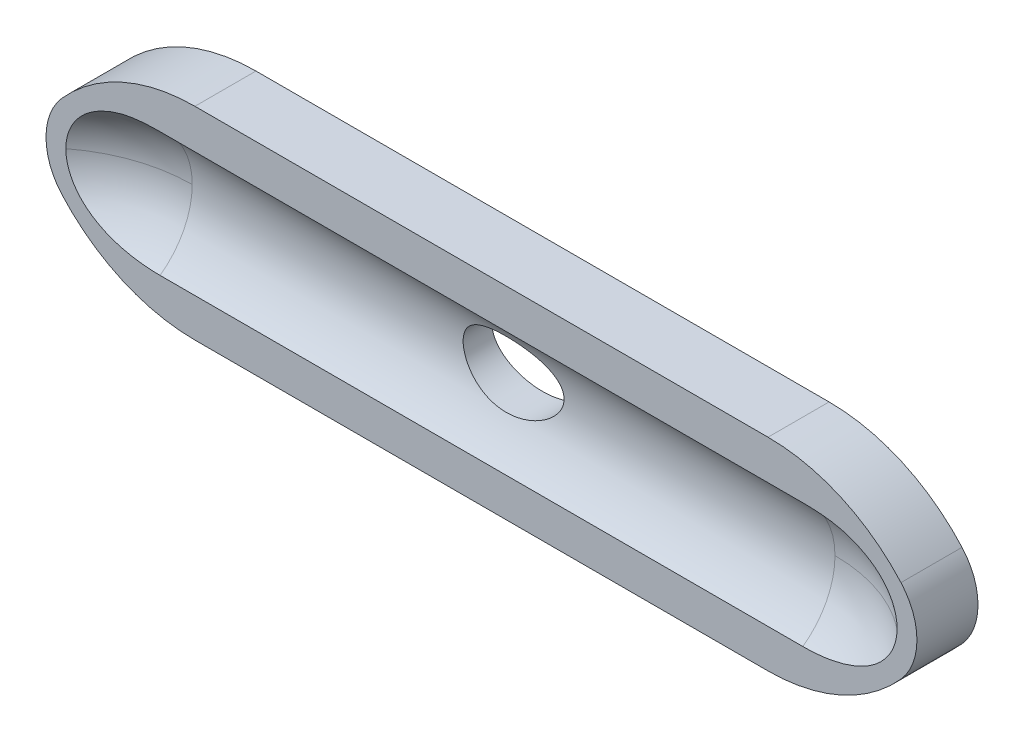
ISO-10303-21;
HEADER;
FILE_DESCRIPTION(('STEP AP214'),'2;1');
FILE_NAME('part.step','',(''),(''),'','','');
FILE_SCHEMA(('AUTOMOTIVE_DESIGN { 1 0 10303 214 1 1 1 1 }'));
ENDSEC;
DATA;
#1=APPLICATION_CONTEXT('core data for automotive mechanical design processes');
#2=APPLICATION_PROTOCOL_DEFINITION('international standard','automotive_design',2000,#1);
#3=PRODUCT_CONTEXT('',#1,'mechanical');
#4=PRODUCT('Part','Part','',(#3));
#5=PRODUCT_RELATED_PRODUCT_CATEGORY('part','',(#4));
#6=PRODUCT_DEFINITION_FORMATION('','',#4);
#7=PRODUCT_DEFINITION_CONTEXT('part definition',#1,'design');
#8=PRODUCT_DEFINITION('design','',#6,#7);
#9=PRODUCT_DEFINITION_SHAPE('','',#8);
#10=(LENGTH_UNIT() NAMED_UNIT(*) SI_UNIT(.MILLI.,.METRE.));
#11=(NAMED_UNIT(*) PLANE_ANGLE_UNIT() SI_UNIT($,.RADIAN.));
#12=(NAMED_UNIT(*) SI_UNIT($,.STERADIAN.) SOLID_ANGLE_UNIT());
#13=UNCERTAINTY_MEASURE_WITH_UNIT(LENGTH_MEASURE(1.E-05),#10,'distance_accuracy_value','');
#14=(GEOMETRIC_REPRESENTATION_CONTEXT(3) GLOBAL_UNCERTAINTY_ASSIGNED_CONTEXT((#13)) GLOBAL_UNIT_ASSIGNED_CONTEXT((#10,
#11,#12)) REPRESENTATION_CONTEXT('',''));
#15=CARTESIAN_POINT('',(0.,0.,0.));
#16=DIRECTION('',(0.,0.,1.));
#17=DIRECTION('',(1.,0.,0.));
#18=AXIS2_PLACEMENT_3D('',#15,#16,#17);
#19=CARTESIAN_POINT('',(-29.,34.9394977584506,-4.75));
#20=DIRECTION('',(0.,0.,1.));
#21=DIRECTION('',(1.,0.,0.));
#22=AXIS2_PLACEMENT_3D('',#19,#20,#21);
#23=CYLINDRICAL_SURFACE('',#22,4.875);
#24=CARTESIAN_POINT('',(-29.,34.9394977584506,0.));
#25=DIRECTION('',(0.,0.,1.));
#26=DIRECTION('',(1.,0.,0.));
#27=AXIS2_PLACEMENT_3D('',#24,#25,#26);
#28=CIRCLE('',#27,4.875);
#29=CARTESIAN_POINT('',(-32.6336104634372,38.1894977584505,0.));
#30=VERTEX_POINT('',#29);
#31=CARTESIAN_POINT('',(-32.6336104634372,31.6894977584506,0.));
#32=VERTEX_POINT('',#31);
#33=EDGE_CURVE('E194',#30,#32,#28,.T.);
#34=ORIENTED_EDGE('',*,*,#33,.F.);
#35=DIRECTION('',(0.,0.,1.));
#36=VECTOR('',#35,1.);
#37=CARTESIAN_POINT('',(-32.6336104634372,38.1894977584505,-4.75));
#38=LINE('',#37,#36);
#39=CARTESIAN_POINT('',(-32.6336104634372,38.1894977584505,-4.75));
#40=VERTEX_POINT('',#39);
#41=EDGE_CURVE('E283',#40,#30,#38,.T.);
#42=ORIENTED_EDGE('',*,*,#41,.F.);
#43=CARTESIAN_POINT('',(-29.,34.9394977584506,-4.75));
#44=DIRECTION('',(0.,0.,1.));
#45=DIRECTION('',(1.,0.,0.));
#46=AXIS2_PLACEMENT_3D('',#43,#44,#45);
#47=CIRCLE('',#46,4.875);
#48=CARTESIAN_POINT('',(-32.6336104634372,31.6894977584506,-4.75));
#49=VERTEX_POINT('',#48);
#50=EDGE_CURVE('E195',#40,#49,#47,.T.);
#51=ORIENTED_EDGE('',*,*,#50,.T.);
#52=DIRECTION('',(0.,0.,1.));
#53=VECTOR('',#52,1.);
#54=CARTESIAN_POINT('',(-32.6336104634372,31.6894977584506,-4.75));
#55=LINE('',#54,#53);
#56=EDGE_CURVE('E285',#49,#32,#55,.T.);
#57=ORIENTED_EDGE('',*,*,#56,.T.);
#58=EDGE_LOOP('',(#34,#42,#51,#57));
#59=FACE_BOUND('',#58,.T.);
#60=ADVANCED_FACE('F35',(#59),#23,.T.);
#61=CARTESIAN_POINT('',(-22.2917960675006,28.9394977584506,-4.75));
#62=DIRECTION('',(0.,0.,1.));
#63=DIRECTION('',(1.,0.,0.));
#64=AXIS2_PLACEMENT_3D('',#61,#62,#63);
#65=CYLINDRICAL_SURFACE('',#64,13.875);
#66=CARTESIAN_POINT('',(-22.2917960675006,28.9394977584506,0.));
#67=DIRECTION('',(0.,0.,1.));
#68=DIRECTION('',(1.,0.,0.));
#69=AXIS2_PLACEMENT_3D('',#66,#67,#68);
#70=CIRCLE('',#69,13.875);
#71=CARTESIAN_POINT('',(-22.2917960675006,42.8144977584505,0.));
#72=VERTEX_POINT('',#71);
#73=EDGE_CURVE('E293',#72,#30,#70,.T.);
#74=ORIENTED_EDGE('',*,*,#73,.F.);
#75=DIRECTION('',(0.,0.,1.));
#76=VECTOR('',#75,1.);
#77=CARTESIAN_POINT('',(-22.2917960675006,42.8144977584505,-4.75));
#78=LINE('',#77,#76);
#79=CARTESIAN_POINT('',(-22.2917960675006,42.8144977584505,-4.75));
#80=VERTEX_POINT('',#79);
#81=EDGE_CURVE('E304',#80,#72,#78,.T.);
#82=ORIENTED_EDGE('',*,*,#81,.F.);
#83=CARTESIAN_POINT('',(-22.2917960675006,28.9394977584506,-4.75));
#84=DIRECTION('',(0.,0.,1.));
#85=DIRECTION('',(1.,0.,0.));
#86=AXIS2_PLACEMENT_3D('',#83,#84,#85);
#87=CIRCLE('',#86,13.875);
#88=EDGE_CURVE('E315',#80,#40,#87,.T.);
#89=ORIENTED_EDGE('',*,*,#88,.T.);
#90=ORIENTED_EDGE('',*,*,#41,.T.);
#91=EDGE_LOOP('',(#74,#82,#89,#90));
#92=FACE_BOUND('',#91,.T.);
#93=ADVANCED_FACE('F238',(#92),#65,.T.);
#94=CARTESIAN_POINT('',(22.2917960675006,42.8144977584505,-4.75));
#95=DIRECTION('',(0.,1.,0.));
#96=DIRECTION('',(0.,0.,1.));
#97=AXIS2_PLACEMENT_3D('',#94,#95,#96);
#98=PLANE('',#97);
#99=DIRECTION('',(-1.,0.,0.));
#100=VECTOR('',#99,1.);
#101=CARTESIAN_POINT('',(22.2917960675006,42.8144977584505,0.));
#102=LINE('',#101,#100);
#103=CARTESIAN_POINT('',(22.2917960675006,42.8144977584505,0.));
#104=VERTEX_POINT('',#103);
#105=EDGE_CURVE('E296',#104,#72,#102,.T.);
#106=ORIENTED_EDGE('',*,*,#105,.F.);
#107=DIRECTION('',(0.,0.,1.));
#108=VECTOR('',#107,1.);
#109=CARTESIAN_POINT('',(22.2917960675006,42.8144977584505,-4.75));
#110=LINE('',#109,#108);
#111=CARTESIAN_POINT('',(22.2917960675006,42.8144977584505,-4.75));
#112=VERTEX_POINT('',#111);
#113=EDGE_CURVE('E306',#112,#104,#110,.T.);
#114=ORIENTED_EDGE('',*,*,#113,.F.);
#115=DIRECTION('',(-1.,0.,0.));
#116=VECTOR('',#115,1.);
#117=CARTESIAN_POINT('',(22.2917960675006,42.8144977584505,-4.75));
#118=LINE('',#117,#116);
#119=EDGE_CURVE('E317',#112,#80,#118,.T.);
#120=ORIENTED_EDGE('',*,*,#119,.T.);
#121=ORIENTED_EDGE('',*,*,#81,.T.);
#122=EDGE_LOOP('',(#106,#114,#120,#121));
#123=FACE_BOUND('',#122,.T.);
#124=ADVANCED_FACE('F277',(#123),#98,.T.);
#125=CARTESIAN_POINT('',(22.2917960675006,28.9394977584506,-4.75));
#126=DIRECTION('',(0.,0.,1.));
#127=DIRECTION('',(1.,0.,0.));
#128=AXIS2_PLACEMENT_3D('',#125,#126,#127);
#129=CYLINDRICAL_SURFACE('',#128,13.875);
#130=CARTESIAN_POINT('',(22.2917960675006,28.9394977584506,0.));
#131=DIRECTION('',(0.,0.,1.));
#132=DIRECTION('',(1.,0.,0.));
#133=AXIS2_PLACEMENT_3D('',#130,#131,#132);
#134=CIRCLE('',#133,13.875);
#135=CARTESIAN_POINT('',(32.6336104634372,38.1894977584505,0.));
#136=VERTEX_POINT('',#135);
#137=EDGE_CURVE('E299',#136,#104,#134,.T.);
#138=ORIENTED_EDGE('',*,*,#137,.F.);
#139=DIRECTION('',(0.,0.,1.));
#140=VECTOR('',#139,1.);
#141=CARTESIAN_POINT('',(32.6336104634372,38.1894977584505,-4.75));
#142=LINE('',#141,#140);
#143=CARTESIAN_POINT('',(32.6336104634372,38.1894977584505,-4.75));
#144=VERTEX_POINT('',#143);
#145=EDGE_CURVE('E308',#144,#136,#142,.T.);
#146=ORIENTED_EDGE('',*,*,#145,.F.);
#147=CARTESIAN_POINT('',(22.2917960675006,28.9394977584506,-4.75));
#148=DIRECTION('',(0.,0.,1.));
#149=DIRECTION('',(1.,0.,0.));
#150=AXIS2_PLACEMENT_3D('',#147,#148,#149);
#151=CIRCLE('',#150,13.875);
#152=EDGE_CURVE('E321',#144,#112,#151,.T.);
#153=ORIENTED_EDGE('',*,*,#152,.T.);
#154=ORIENTED_EDGE('',*,*,#113,.T.);
#155=EDGE_LOOP('',(#138,#146,#153,#154));
#156=FACE_BOUND('',#155,.T.);
#157=ADVANCED_FACE('F337',(#156),#129,.T.);
#158=CARTESIAN_POINT('',(29.,34.9394977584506,-4.75));
#159=DIRECTION('',(0.,0.,1.));
#160=DIRECTION('',(1.,0.,0.));
#161=AXIS2_PLACEMENT_3D('',#158,#159,#160);
#162=CYLINDRICAL_SURFACE('',#161,4.875);
#163=CARTESIAN_POINT('',(29.,34.9394977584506,0.));
#164=DIRECTION('',(0.,0.,1.));
#165=DIRECTION('',(1.,0.,0.));
#166=AXIS2_PLACEMENT_3D('',#163,#164,#165);
#167=CIRCLE('',#166,4.875);
#168=CARTESIAN_POINT('',(32.6336104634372,31.6894977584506,0.));
#169=VERTEX_POINT('',#168);
#170=EDGE_CURVE('E332',#169,#136,#167,.T.);
#171=ORIENTED_EDGE('',*,*,#170,.F.);
#172=DIRECTION('',(0.,0.,1.));
#173=VECTOR('',#172,1.);
#174=CARTESIAN_POINT('',(32.6336104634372,31.6894977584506,-4.75));
#175=LINE('',#174,#173);
#176=CARTESIAN_POINT('',(32.6336104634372,31.6894977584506,-4.75));
#177=VERTEX_POINT('',#176);
#178=EDGE_CURVE('E310',#177,#169,#175,.T.);
#179=ORIENTED_EDGE('',*,*,#178,.F.);
#180=CARTESIAN_POINT('',(29.,34.9394977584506,-4.75));
#181=DIRECTION('',(0.,0.,1.));
#182=DIRECTION('',(1.,0.,0.));
#183=AXIS2_PLACEMENT_3D('',#180,#181,#182);
#184=CIRCLE('',#183,4.875);
#185=EDGE_CURVE('E355',#177,#144,#184,.T.);
#186=ORIENTED_EDGE('',*,*,#185,.T.);
#187=ORIENTED_EDGE('',*,*,#145,.T.);
#188=EDGE_LOOP('',(#171,#179,#186,#187));
#189=FACE_BOUND('',#188,.T.);
#190=ADVANCED_FACE('F359',(#189),#162,.T.);
#191=CARTESIAN_POINT('',(22.2917960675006,40.9394977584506,-4.75));
#192=DIRECTION('',(0.,0.,1.));
#193=DIRECTION('',(1.,0.,0.));
#194=AXIS2_PLACEMENT_3D('',#191,#192,#193);
#195=CYLINDRICAL_SURFACE('',#194,13.875);
#196=CARTESIAN_POINT('',(22.2917960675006,40.9394977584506,0.));
#197=DIRECTION('',(0.,0.,1.));
#198=DIRECTION('',(1.,0.,0.));
#199=AXIS2_PLACEMENT_3D('',#196,#197,#198);
#200=CIRCLE('',#199,13.875);
#201=CARTESIAN_POINT('',(22.2917960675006,27.0644977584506,0.));
#202=VERTEX_POINT('',#201);
#203=EDGE_CURVE('E329',#202,#169,#200,.T.);
#204=ORIENTED_EDGE('',*,*,#203,.F.);
#205=DIRECTION('',(0.,0.,1.));
#206=VECTOR('',#205,1.);
#207=CARTESIAN_POINT('',(22.2917960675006,27.0644977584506,-4.75));
#208=LINE('',#207,#206);
#209=CARTESIAN_POINT('',(22.2917960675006,27.0644977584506,-4.75));
#210=VERTEX_POINT('',#209);
#211=EDGE_CURVE('E312',#210,#202,#208,.T.);
#212=ORIENTED_EDGE('',*,*,#211,.F.);
#213=CARTESIAN_POINT('',(22.2917960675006,40.9394977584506,-4.75));
#214=DIRECTION('',(0.,0.,1.));
#215=DIRECTION('',(1.,0.,0.));
#216=AXIS2_PLACEMENT_3D('',#213,#214,#215);
#217=CIRCLE('',#216,13.875);
#218=EDGE_CURVE('E350',#210,#177,#217,.T.);
#219=ORIENTED_EDGE('',*,*,#218,.T.);
#220=ORIENTED_EDGE('',*,*,#178,.T.);
#221=EDGE_LOOP('',(#204,#212,#219,#220));
#222=FACE_BOUND('',#221,.T.);
#223=ADVANCED_FACE('F362',(#222),#195,.T.);
#224=CARTESIAN_POINT('',(-22.2917960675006,27.0644977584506,-4.75));
#225=DIRECTION('',(0.,-1.,0.));
#226=DIRECTION('',(1.,0.,0.));
#227=AXIS2_PLACEMENT_3D('',#224,#225,#226);
#228=PLANE('',#227);
#229=DIRECTION('',(1.,0.,0.));
#230=VECTOR('',#229,1.);
#231=CARTESIAN_POINT('',(-22.2917960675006,27.0644977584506,0.));
#232=LINE('',#231,#230);
#233=CARTESIAN_POINT('',(-22.2917960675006,27.0644977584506,0.));
#234=VERTEX_POINT('',#233);
#235=EDGE_CURVE('E326',#234,#202,#232,.T.);
#236=ORIENTED_EDGE('',*,*,#235,.F.);
#237=DIRECTION('',(0.,0.,1.));
#238=VECTOR('',#237,1.);
#239=CARTESIAN_POINT('',(-22.2917960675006,27.0644977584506,-4.75));
#240=LINE('',#239,#238);
#241=CARTESIAN_POINT('',(-22.2917960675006,27.0644977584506,-4.75));
#242=VERTEX_POINT('',#241);
#243=EDGE_CURVE('E314',#242,#234,#240,.T.);
#244=ORIENTED_EDGE('',*,*,#243,.F.);
#245=DIRECTION('',(1.,0.,0.));
#246=VECTOR('',#245,1.);
#247=CARTESIAN_POINT('',(-22.2917960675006,27.0644977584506,-4.75));
#248=LINE('',#247,#246);
#249=EDGE_CURVE('E348',#242,#210,#248,.T.);
#250=ORIENTED_EDGE('',*,*,#249,.T.);
#251=ORIENTED_EDGE('',*,*,#211,.T.);
#252=EDGE_LOOP('',(#236,#244,#250,#251));
#253=FACE_BOUND('',#252,.T.);
#254=ADVANCED_FACE('F365',(#253),#228,.T.);
#255=CARTESIAN_POINT('',(-22.2917960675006,40.9394977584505,-4.75));
#256=DIRECTION('',(0.,0.,1.));
#257=DIRECTION('',(1.,0.,0.));
#258=AXIS2_PLACEMENT_3D('',#255,#256,#257);
#259=CYLINDRICAL_SURFACE('',#258,13.875);
#260=CARTESIAN_POINT('',(-22.2917960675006,40.9394977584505,0.));
#261=DIRECTION('',(0.,0.,1.));
#262=DIRECTION('',(1.,0.,0.));
#263=AXIS2_PLACEMENT_3D('',#260,#261,#262);
#264=CIRCLE('',#263,13.875);
#265=EDGE_CURVE('E289',#32,#234,#264,.T.);
#266=ORIENTED_EDGE('',*,*,#265,.F.);
#267=ORIENTED_EDGE('',*,*,#56,.F.);
#268=CARTESIAN_POINT('',(-22.2917960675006,40.9394977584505,-4.75));
#269=DIRECTION('',(0.,0.,1.));
#270=DIRECTION('',(1.,0.,0.));
#271=AXIS2_PLACEMENT_3D('',#268,#269,#270);
#272=CIRCLE('',#271,13.875);
#273=EDGE_CURVE('E298',#49,#242,#272,.T.);
#274=ORIENTED_EDGE('',*,*,#273,.T.);
#275=ORIENTED_EDGE('',*,*,#243,.T.);
#276=EDGE_LOOP('',(#266,#267,#274,#275));
#277=FACE_BOUND('',#276,.T.);
#278=ADVANCED_FACE('F366',(#277),#259,.T.);
#279=CARTESIAN_POINT('',(-29.,34.9394977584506,-4.75));
#280=DIRECTION('',(0.,0.,1.));
#281=DIRECTION('',(1.,0.,0.));
#282=AXIS2_PLACEMENT_3D('',#279,#280,#281);
#283=PLANE('',#282);
#284=CARTESIAN_POINT('',(0.,34.9394977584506,-4.75));
#285=DIRECTION('',(0.,0.,1.));
#286=DIRECTION('',(-1.,0.,0.));
#287=AXIS2_PLACEMENT_3D('',#284,#285,#286);
#288=ELLIPSE('',#287,3.925,2.5625);
#289=CARTESIAN_POINT('',(-3.925,34.9394977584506,-4.75));
#290=VERTEX_POINT('',#289);
#291=EDGE_CURVE('E184',#290,#290,#288,.T.);
#292=ORIENTED_EDGE('',*,*,#291,.T.);
#293=EDGE_LOOP('',(#292));
#294=FACE_BOUND('',#293,.T.);
#295=ORIENTED_EDGE('',*,*,#50,.F.);
#296=ORIENTED_EDGE('',*,*,#88,.F.);
#297=ORIENTED_EDGE('',*,*,#119,.F.);
#298=ORIENTED_EDGE('',*,*,#152,.F.);
#299=ORIENTED_EDGE('',*,*,#185,.F.);
#300=ORIENTED_EDGE('',*,*,#218,.F.);
#301=ORIENTED_EDGE('',*,*,#249,.F.);
#302=ORIENTED_EDGE('',*,*,#273,.F.);
#303=EDGE_LOOP('',(#295,#296,#297,#298,#299,#300,#301,#302));
#304=FACE_BOUND('',#303,.T.);
#305=ADVANCED_FACE('F209',(#294,#304),#283,.F.);
#306=CARTESIAN_POINT('',(-29.,34.9394977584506,0.));
#307=DIRECTION('',(0.,0.,1.));
#308=DIRECTION('',(1.,0.,0.));
#309=AXIS2_PLACEMENT_3D('',#306,#307,#308);
#310=PLANE('',#309);
#311=CARTESIAN_POINT('',(-29.9062379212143,31.1999625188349,0.));
#312=CARTESIAN_POINT('',(-29.464241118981,30.9454848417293,0.));
#313=CARTESIAN_POINT('',(-28.9914220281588,30.7428983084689,0.));
#314=CARTESIAN_POINT('',(-28.2615760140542,30.5034285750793,0.));
#315=CARTESIAN_POINT('',(-28.0136709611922,30.4341729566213,0.));
#316=CARTESIAN_POINT('',(-27.5131595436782,30.3149502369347,0.));
#317=CARTESIAN_POINT('',(-27.2605545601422,30.2649775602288,0.));
#318=CARTESIAN_POINT('',(-26.830598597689,30.1950790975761,0.));
#319=CARTESIAN_POINT('',(-26.6539388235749,30.170638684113,0.));
#320=CARTESIAN_POINT('',(-26.2996953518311,30.1295771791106,0.));
#321=CARTESIAN_POINT('',(-26.1221116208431,30.1129563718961,0.));
#322=CARTESIAN_POINT('',(-25.7663021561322,30.0871633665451,0.));
#323=CARTESIAN_POINT('',(-25.5880760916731,30.0779958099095,0.));
#324=CARTESIAN_POINT('',(-25.2313825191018,30.0669150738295,0.));
#325=CARTESIAN_POINT('',(-25.0529149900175,30.0650025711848,0.));
#326=CARTESIAN_POINT('',(-24.6965499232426,30.068385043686,0.));
#327=CARTESIAN_POINT('',(-24.5186521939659,30.0736597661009,0.));
#328=CARTESIAN_POINT('',(-24.1631989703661,30.0915030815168,0.));
#329=CARTESIAN_POINT('',(-23.985643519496,30.1040725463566,0.));
#330=CARTESIAN_POINT('',(-23.6313761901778,30.1367752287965,0.));
#331=CARTESIAN_POINT('',(-23.4546637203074,30.1569019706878,0.));
#332=CARTESIAN_POINT('',(-23.1023362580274,30.2051522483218,0.));
#333=CARTESIAN_POINT('',(-22.9267212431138,30.2332756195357,0.));
#334=CARTESIAN_POINT('',(-22.5530396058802,30.3025478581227,0.));
#335=CARTESIAN_POINT('',(-22.3552004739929,30.3449548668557,0.));
#336=CARTESIAN_POINT('',(-21.9625351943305,30.4418620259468,0.));
#337=CARTESIAN_POINT('',(-21.7677093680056,30.4963634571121,0.));
#338=CARTESIAN_POINT('',(-21.1901058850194,30.6796001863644,0.));
#339=CARTESIAN_POINT('',(-20.8131580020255,30.8282473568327,0.));
#340=CARTESIAN_POINT('',(-20.1730496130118,31.1469614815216,0.));
#341=CARTESIAN_POINT('',(-19.9036019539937,31.3043240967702,0.));
#342=CARTESIAN_POINT('',(-19.3929011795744,31.6599090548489,0.));
#343=CARTESIAN_POINT('',(-19.1516150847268,31.8580828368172,0.));
#344=CARTESIAN_POINT('',(-18.7576577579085,32.24884168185,0.));
#345=CARTESIAN_POINT('',(-18.597101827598,32.433394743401,0.));
#346=CARTESIAN_POINT('',(-18.380566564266,32.7279630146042,0.));
#347=CARTESIAN_POINT('',(-18.3124183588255,32.8291473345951,0.));
#348=CARTESIAN_POINT('',(-18.1851081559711,33.0369972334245,0.));
#349=CARTESIAN_POINT('',(-18.1259422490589,33.1436604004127,0.));
#350=CARTESIAN_POINT('',(-18.017013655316,33.3627699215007,0.));
#351=CARTESIAN_POINT('',(-17.967330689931,33.4752559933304,0.));
#352=CARTESIAN_POINT('',(-17.8787956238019,33.7043625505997,0.));
#353=CARTESIAN_POINT('',(-17.8399381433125,33.8209809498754,0.));
#354=CARTESIAN_POINT('',(-17.7737144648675,34.0574141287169,0.));
#355=CARTESIAN_POINT('',(-17.7463455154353,34.1772281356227,0.));
#356=CARTESIAN_POINT('',(-17.7035979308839,34.4189723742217,0.));
#357=CARTESIAN_POINT('',(-17.6882176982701,34.5409023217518,0.));
#358=CARTESIAN_POINT('',(-17.670880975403,34.7705165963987,0.));
#359=CARTESIAN_POINT('',(-17.6674981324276,34.8780954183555,0.));
#360=CARTESIAN_POINT('',(-17.6702042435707,35.093172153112,0.));
#361=CARTESIAN_POINT('',(-17.6762963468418,35.2006700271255,0.));
#362=CARTESIAN_POINT('',(-17.6978658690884,35.4146534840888,0.));
#363=CARTESIAN_POINT('',(-17.7133372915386,35.5211396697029,0.));
#364=CARTESIAN_POINT('',(-17.7534223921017,35.7323898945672,0.));
#365=CARTESIAN_POINT('',(-17.7780395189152,35.8371532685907,0.));
#366=CARTESIAN_POINT('',(-17.8630926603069,36.1404283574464,0.));
#367=CARTESIAN_POINT('',(-17.935565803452,36.3356881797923,0.));
#368=CARTESIAN_POINT('',(-18.109807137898,36.712445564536,0.));
#369=CARTESIAN_POINT('',(-18.2115800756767,36.8939408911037,0.));
#370=CARTESIAN_POINT('',(-18.4495930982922,37.2546907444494,0.));
#371=CARTESIAN_POINT('',(-18.5879871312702,37.432519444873,0.));
#372=CARTESIAN_POINT('',(-18.8884083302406,37.7668178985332,0.));
#373=CARTESIAN_POINT('',(-19.0504500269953,37.9232744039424,0.));
#374=CARTESIAN_POINT('',(-19.4840329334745,38.2918367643,0.));
#375=CARTESIAN_POINT('',(-19.7680083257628,38.4893413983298,0.));
#376=CARTESIAN_POINT('',(-20.3637889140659,38.8364544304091,0.));
#377=CARTESIAN_POINT('',(-20.6756496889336,38.9859643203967,0.));
#378=CARTESIAN_POINT('',(-21.2418764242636,39.2129729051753,0.));
#379=CARTESIAN_POINT('',(-21.4928764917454,39.2991283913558,0.));
#380=CARTESIAN_POINT('',(-22.0015148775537,39.4492920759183,0.));
#381=CARTESIAN_POINT('',(-22.2591570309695,39.5132871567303,0.));
#382=CARTESIAN_POINT('',(-22.7794770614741,39.6217829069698,0.));
#383=CARTESIAN_POINT('',(-23.0421705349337,39.666207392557,0.));
#384=CARTESIAN_POINT('',(-23.5698773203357,39.7372017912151,0.));
#385=CARTESIAN_POINT('',(-23.8348903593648,39.7637737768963,0.));
#386=CARTESIAN_POINT('',(-24.4482884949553,39.8060900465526,0.));
#387=CARTESIAN_POINT('',(-24.7970875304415,39.8159364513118,0.));
#388=CARTESIAN_POINT('',(-25.4945770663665,39.8082453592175,0.));
#389=CARTESIAN_POINT('',(-25.8432673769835,39.7906914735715,0.));
#390=CARTESIAN_POINT('',(-26.536753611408,39.7267247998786,0.));
#391=CARTESIAN_POINT('',(-26.8815592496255,39.6804207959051,0.));
#392=CARTESIAN_POINT('',(-27.5649995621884,39.5553457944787,0.));
#393=CARTESIAN_POINT('',(-27.903640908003,39.476612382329,0.));
#394=CARTESIAN_POINT('',(-28.5655184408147,39.2825276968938,0.));
#395=CARTESIAN_POINT('',(-28.8889016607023,39.1676899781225,0.));
#396=CARTESIAN_POINT('',(-29.5171242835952,38.8950551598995,0.));
#397=CARTESIAN_POINT('',(-29.8219858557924,38.7373107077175,0.));
#398=CARTESIAN_POINT('',(-30.356142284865,38.40215963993,0.));
#399=CARTESIAN_POINT('',(-30.5897803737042,38.2317494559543,0.));
#400=CARTESIAN_POINT('',(-31.0262889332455,37.8550030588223,0.));
#401=CARTESIAN_POINT('',(-31.2291938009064,37.6487075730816,0.));
#402=CARTESIAN_POINT('',(-31.5569906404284,37.2458967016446,0.));
#403=CARTESIAN_POINT('',(-31.6893755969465,37.0554967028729,0.));
#404=CARTESIAN_POINT('',(-31.9208921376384,36.6553347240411,0.));
#405=CARTESIAN_POINT('',(-32.0200397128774,36.4455821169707,0.));
#406=CARTESIAN_POINT('',(-32.1799431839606,36.010437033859,0.));
#407=CARTESIAN_POINT('',(-32.2404808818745,35.7849635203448,0.));
#408=CARTESIAN_POINT('',(-32.318272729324,35.3266439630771,0.));
#409=CARTESIAN_POINT('',(-32.335543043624,35.0938007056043,0.));
#410=CARTESIAN_POINT('',(-32.3261470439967,34.6514005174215,0.));
#411=CARTESIAN_POINT('',(-32.3035251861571,34.441746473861,0.));
#412=CARTESIAN_POINT('',(-32.2232973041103,34.0293145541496,0.));
#413=CARTESIAN_POINT('',(-32.1656961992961,33.8265357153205,0.));
#414=CARTESIAN_POINT('',(-32.0186388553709,33.4332117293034,0.));
#415=CARTESIAN_POINT('',(-31.9292123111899,33.2426553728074,0.));
#416=CARTESIAN_POINT('',(-31.7226615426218,32.8772480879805,0.));
#417=CARTESIAN_POINT('',(-31.6055255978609,32.7024038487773,0.));
#418=CARTESIAN_POINT('',(-31.334013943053,32.3524659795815,0.));
#419=CARTESIAN_POINT('',(-31.1769577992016,32.1794652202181,0.));
#420=CARTESIAN_POINT('',(-30.8405978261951,31.8568951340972,0.));
#421=CARTESIAN_POINT('',(-30.6612954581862,31.7073242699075,0.));
#422=CARTESIAN_POINT('',(-30.3826451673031,31.5024112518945,0.));
#423=CARTESIAN_POINT('',(-30.2896552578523,31.4381992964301,0.));
#424=CARTESIAN_POINT('',(-30.100356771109,31.315135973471,0.));
#425=CARTESIAN_POINT('',(-30.0040520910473,31.2562785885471,0.));
#426=CARTESIAN_POINT('',(-29.9062379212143,31.1999625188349,0.));
#427=B_SPLINE_CURVE_WITH_KNOTS('',3,(#311,#312,#313,#314,#315,#316,#317,#318,#319,#320,#321,
#322,#323,#324,#325,#326,#327,#328,#329,#330,#331,#332,#333,#334,#335,#336,#337,#338,#339,#340,
#341,#342,#343,#344,#345,#346,#347,#348,#349,#350,#351,#352,#353,#354,#355,#356,#357,#358,#359,
#360,#361,#362,#363,#364,#365,#366,#367,#368,#369,#370,#371,#372,#373,#374,#375,#376,#377,#378,
#379,#380,#381,#382,#383,#384,#385,#386,#387,#388,#389,#390,#391,#392,#393,#394,#395,#396,#397,
#398,#399,#400,#401,#402,#403,#404,#405,#406,#407,#408,#409,#410,#411,#412,#413,#414,#415,#416,
#417,#418,#419,#420,#421,#422,#423,#424,#425,#426),.UNSPECIFIED.,.T.,.F.,(4,2,2,2,2,2,2,2,2,2,2,
2,2,2,2,2,2,2,2,2,2,2,2,2,2,2,2,2,2,2,2,2,2,2,2,2,2,2,2,2,2,2,2,2,2,2,2,2,2,2,2,2,2,2,2,2,2,4),
(0.,1.52949977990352,2.30137314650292,3.07302316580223,3.60790796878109,4.14281221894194,
4.67804932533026,5.21333636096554,5.74711813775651,6.28096372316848,6.81435290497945,
7.34773111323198,7.95433234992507,8.56099785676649,9.77117223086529,10.7041625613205,
11.6360490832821,12.3667276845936,12.7323225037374,13.0977577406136,13.4661414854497,
13.8343418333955,14.202453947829,14.5705170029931,14.8930055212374,15.2156012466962,
15.5379909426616,15.8605023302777,16.482399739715,17.1043979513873,17.777820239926,
18.4516580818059,19.4835256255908,20.5174977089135,21.3125507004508,22.1080735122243,
22.9066663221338,23.7051664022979,24.7508423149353,25.7971439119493,26.8395104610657,
27.8806723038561,28.9076477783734,29.9333687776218,30.7977371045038,31.6611307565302,
32.3540024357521,33.0465402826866,33.7429580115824,34.4391155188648,35.0686868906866,
35.6981697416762,36.3270667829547,36.9562303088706,37.6546789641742,38.3530817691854,
38.6919466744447,39.0304259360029),.UNSPECIFIED.);
#428=CARTESIAN_POINT('',(-32.3314391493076,34.9394977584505,0.));
#429=VERTEX_POINT('',#428);
#430=CARTESIAN_POINT('',(-25.,30.0661005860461,0.));
#431=VERTEX_POINT('',#430);
#432=EDGE_CURVE('E11',#429,#431,#427,.T.);
#433=ORIENTED_EDGE('',*,*,#432,.F.);
#434=CARTESIAN_POINT('',(-30.4200188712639,38.3486226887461,0.));
#435=CARTESIAN_POINT('',(-30.6246378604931,38.2017681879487,0.));
#436=CARTESIAN_POINT('',(-30.8197297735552,38.0414636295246,0.));
#437=CARTESIAN_POINT('',(-31.1841477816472,37.6932594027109,0.));
#438=CARTESIAN_POINT('',(-31.3534681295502,37.5053535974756,0.));
#439=CARTESIAN_POINT('',(-31.5826598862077,37.2034819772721,0.));
#440=CARTESIAN_POINT('',(-31.6552028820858,37.0989919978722,0.));
#441=CARTESIAN_POINT('',(-31.7906643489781,36.8839695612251,0.));
#442=CARTESIAN_POINT('',(-31.8535873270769,36.7734399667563,0.));
#443=CARTESIAN_POINT('',(-31.9688057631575,36.5470202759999,0.));
#444=CARTESIAN_POINT('',(-32.0211054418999,36.4311323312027,0.));
#445=CARTESIAN_POINT('',(-32.1142026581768,36.1948192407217,0.));
#446=CARTESIAN_POINT('',(-32.1550015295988,36.0743946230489,0.));
#447=CARTESIAN_POINT('',(-32.2212238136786,35.8410320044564,0.));
#448=CARTESIAN_POINT('',(-32.247698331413,35.7283917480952,0.));
#449=CARTESIAN_POINT('',(-32.2900553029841,35.5011419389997,0.));
#450=CARTESIAN_POINT('',(-32.3059388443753,35.3865325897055,0.));
#451=CARTESIAN_POINT('',(-32.3268376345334,35.1563585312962,0.));
#452=CARTESIAN_POINT('',(-32.3318567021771,35.0407941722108,0.));
#453=CARTESIAN_POINT('',(-32.3309663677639,34.8097442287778,0.));
#454=CARTESIAN_POINT('',(-32.3250576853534,34.6942586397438,0.));
#455=CARTESIAN_POINT('',(-32.2932959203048,34.3724079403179,0.));
#456=CARTESIAN_POINT('',(-32.2552834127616,34.1671201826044,0.));
#457=CARTESIAN_POINT('',(-32.1461094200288,33.7657703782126,0.));
#458=CARTESIAN_POINT('',(-32.0749511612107,33.5697074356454,0.));
#459=CARTESIAN_POINT('',(-31.9009360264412,33.1864939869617,0.));
#460=CARTESIAN_POINT('',(-31.7973483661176,32.9996774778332,0.));
#461=CARTESIAN_POINT('',(-31.5636897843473,32.6434047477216,0.));
#462=CARTESIAN_POINT('',(-31.4336041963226,32.4739582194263,0.));
#463=CARTESIAN_POINT('',(-31.1939505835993,32.2019725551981,0.));
#464=CARTESIAN_POINT('',(-31.0898281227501,32.0945471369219,0.));
#465=CARTESIAN_POINT('',(-30.8725118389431,31.8892604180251,0.));
#466=CARTESIAN_POINT('',(-30.7593151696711,31.7914021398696,0.));
#467=CARTESIAN_POINT('',(-30.4081579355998,31.512060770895,0.));
#468=CARTESIAN_POINT('',(-30.1587251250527,31.3449158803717,0.));
#469=CARTESIAN_POINT('',(-29.5257665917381,30.9815192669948,0.));
#470=CARTESIAN_POINT('',(-29.1313074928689,30.8045109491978,0.));
#471=CARTESIAN_POINT('',(-28.5231343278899,30.586343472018,0.));
#472=CARTESIAN_POINT('',(-28.3172544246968,30.5214335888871,0.));
#473=CARTESIAN_POINT('',(-27.90148944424,30.4059782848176,0.));
#474=CARTESIAN_POINT('',(-27.6916049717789,30.3554307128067,0.));
#475=CARTESIAN_POINT('',(-27.1440251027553,30.2412785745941,0.));
#476=CARTESIAN_POINT('',(-26.8042489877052,30.1876696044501,0.));
#477=CARTESIAN_POINT('',(-26.1212644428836,30.1093033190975,0.));
#478=CARTESIAN_POINT('',(-25.7780535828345,30.0845681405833,0.));
#479=CARTESIAN_POINT('',(-25.0905833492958,30.0619165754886,0.));
#480=CARTESIAN_POINT('',(-24.7463235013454,30.0640150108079,0.));
#481=CARTESIAN_POINT('',(-24.0591712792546,30.0952360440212,0.));
#482=CARTESIAN_POINT('',(-23.7162781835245,30.1243417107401,0.));
#483=CARTESIAN_POINT('',(-23.1491966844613,30.1972476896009,0.));
#484=CARTESIAN_POINT('',(-22.9239343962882,30.2327941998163,0.));
#485=CARTESIAN_POINT('',(-22.4761293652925,30.3180643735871,0.));
#486=CARTESIAN_POINT('',(-22.2535859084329,30.3677842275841,0.));
#487=CARTESIAN_POINT('',(-21.813086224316,30.4827662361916,0.));
#488=CARTESIAN_POINT('',(-21.5951199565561,30.5479893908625,0.));
#489=CARTESIAN_POINT('',(-21.1651886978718,30.6957071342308,0.));
#490=CARTESIAN_POINT('',(-20.9532214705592,30.7781951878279,0.));
#491=CARTESIAN_POINT('',(-20.4528688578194,30.9997965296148,0.));
#492=CARTESIAN_POINT('',(-20.1685098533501,31.1482904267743,0.));
#493=CARTESIAN_POINT('',(-19.625993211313,31.4874245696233,0.));
#494=CARTESIAN_POINT('',(-19.3678065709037,31.6780174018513,0.));
#495=CARTESIAN_POINT('',(-18.9409371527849,32.058426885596,0.));
#496=CARTESIAN_POINT('',(-18.7648789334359,32.2398604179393,0.));
#497=CARTESIAN_POINT('',(-18.524776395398,32.5316360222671,0.));
#498=CARTESIAN_POINT('',(-18.4487147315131,32.6322084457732,0.));
#499=CARTESIAN_POINT('',(-18.3055742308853,32.8395298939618,0.));
#500=CARTESIAN_POINT('',(-18.2384913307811,32.9462760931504,0.));
#501=CARTESIAN_POINT('',(-18.1137108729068,33.1664251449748,0.));
#502=CARTESIAN_POINT('',(-18.0561046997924,33.2798799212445,0.));
#503=CARTESIAN_POINT('',(-17.9520096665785,33.5117260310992,0.));
#504=CARTESIAN_POINT('',(-17.9055149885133,33.6301147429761,0.));
#505=CARTESIAN_POINT('',(-17.8244639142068,33.8708708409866,0.));
#506=CARTESIAN_POINT('',(-17.7899029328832,33.9932366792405,0.));
#507=CARTESIAN_POINT('',(-17.733369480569,34.2408382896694,0.));
#508=CARTESIAN_POINT('',(-17.7113949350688,34.3660735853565,0.));
#509=CARTESIAN_POINT('',(-17.6826341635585,34.6004989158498,0.));
#510=CARTESIAN_POINT('',(-17.6741538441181,34.7094839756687,0.));
#511=CARTESIAN_POINT('',(-17.6669525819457,34.9278162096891,0.));
#512=CARTESIAN_POINT('',(-17.6682348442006,35.0371634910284,0.));
#513=CARTESIAN_POINT('',(-17.6805486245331,35.2552346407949,0.));
#514=CARTESIAN_POINT('',(-17.6915733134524,35.3639588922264,0.));
#515=CARTESIAN_POINT('',(-17.7231816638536,35.580021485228,0.));
#516=CARTESIAN_POINT('',(-17.7437688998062,35.6873592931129,0.));
#517=CARTESIAN_POINT('',(-17.8168273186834,35.9949229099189,0.));
#518=CARTESIAN_POINT('',(-17.8813490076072,36.1924087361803,0.));
#519=CARTESIAN_POINT('',(-18.0405093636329,36.5746242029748,0.));
#520=CARTESIAN_POINT('',(-18.135150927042,36.7593526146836,0.));
#521=CARTESIAN_POINT('',(-18.3579139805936,37.1252247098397,0.));
#522=CARTESIAN_POINT('',(-18.4879064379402,37.3052251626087,0.));
#523=CARTESIAN_POINT('',(-18.7721690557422,37.6447992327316,0.));
#524=CARTESIAN_POINT('',(-18.9264543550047,37.8043599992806,0.));
#525=CARTESIAN_POINT('',(-19.3361950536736,38.1768929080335,0.));
#526=CARTESIAN_POINT('',(-19.6036622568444,38.3766767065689,0.));
#527=CARTESIAN_POINT('',(-20.1671128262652,38.7307315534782,0.));
#528=CARTESIAN_POINT('',(-20.4631495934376,38.8849150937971,0.));
#529=CARTESIAN_POINT('',(-20.9987481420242,39.1200043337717,0.));
#530=CARTESIAN_POINT('',(-21.2345998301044,39.2096130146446,0.));
#531=CARTESIAN_POINT('',(-21.7133102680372,39.3679220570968,0.));
#532=CARTESIAN_POINT('',(-21.9561728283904,39.4366108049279,0.));
#533=CARTESIAN_POINT('',(-22.4471751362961,39.5554893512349,0.));
#534=CARTESIAN_POINT('',(-22.6953299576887,39.6056157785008,0.));
#535=CARTESIAN_POINT('',(-23.1944073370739,39.688994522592,0.));
#536=CARTESIAN_POINT('',(-23.4453296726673,39.7222481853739,0.));
#537=CARTESIAN_POINT('',(-23.8747455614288,39.7657974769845,0.));
#538=CARTESIAN_POINT('',(-24.05286193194,39.7799676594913,0.));
#539=CARTESIAN_POINT('',(-24.4095441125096,39.8009113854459,0.));
#540=CARTESIAN_POINT('',(-24.5881099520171,39.8076844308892,0.));
#541=CARTESIAN_POINT('',(-24.945467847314,39.8139918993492,0.));
#542=CARTESIAN_POINT('',(-25.124259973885,39.8135222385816,0.));
#543=CARTESIAN_POINT('',(-25.4816922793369,39.8053226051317,0.));
#544=CARTESIAN_POINT('',(-25.6603324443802,39.7975920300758,0.));
#545=CARTESIAN_POINT('',(-26.0169776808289,39.7747025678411,0.));
#546=CARTESIAN_POINT('',(-26.1949831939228,39.759550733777,0.));
#547=CARTESIAN_POINT('',(-26.5501623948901,39.7214790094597,0.));
#548=CARTESIAN_POINT('',(-26.7273359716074,39.6985581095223,0.));
#549=CARTESIAN_POINT('',(-27.2566942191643,39.6174830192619,0.));
#550=CARTESIAN_POINT('',(-27.6071665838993,39.5469898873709,0.));
#551=CARTESIAN_POINT('',(-28.1726775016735,39.4002881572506,0.));
#552=CARTESIAN_POINT('',(-28.3906962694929,39.3354434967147,0.));
#553=CARTESIAN_POINT('',(-28.8208128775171,39.1885062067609,0.));
#554=CARTESIAN_POINT('',(-29.0329136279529,39.1064222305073,0.));
#555=CARTESIAN_POINT('',(-29.4478779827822,38.9236403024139,0.));
#556=CARTESIAN_POINT('',(-29.6507790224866,38.823028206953,0.));
#557=CARTESIAN_POINT('',(-30.0450118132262,38.6014188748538,0.));
#558=CARTESIAN_POINT('',(-30.2363532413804,38.480439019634,0.));
#559=CARTESIAN_POINT('',(-30.4200188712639,38.3486226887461,0.));
#560=B_SPLINE_CURVE_WITH_KNOTS('',3,(#434,#435,#436,#437,#438,#439,#440,#441,#442,#443,#444,
#445,#446,#447,#448,#449,#450,#451,#452,#453,#454,#455,#456,#457,#458,#459,#460,#461,#462,#463,
#464,#465,#466,#467,#468,#469,#470,#471,#472,#473,#474,#475,#476,#477,#478,#479,#480,#481,#482,
#483,#484,#485,#486,#487,#488,#489,#490,#491,#492,#493,#494,#495,#496,#497,#498,#499,#500,#501,
#502,#503,#504,#505,#506,#507,#508,#509,#510,#511,#512,#513,#514,#515,#516,#517,#518,#519,#520,
#521,#522,#523,#524,#525,#526,#527,#528,#529,#530,#531,#532,#533,#534,#535,#536,#537,#538,#539,
#540,#541,#542,#543,#544,#545,#546,#547,#548,#549,#550,#551,#552,#553,#554,#555,#556,#557,#558,
#559),.UNSPECIFIED.,.T.,.F.,(4,2,2,2,2,2,2,2,2,2,2,2,2,2,2,2,2,2,2,2,2,2,2,2,2,2,2,2,2,2,2,2,2,
2,2,2,2,2,2,2,2,2,2,2,2,2,2,2,2,2,2,2,2,2,2,2,2,2,2,2,2,2,4),(0.,0.755116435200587,
1.51040101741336,1.89158730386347,2.27259444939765,2.6534499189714,3.0342611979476,
3.38090435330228,3.72751190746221,4.07399760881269,4.42046049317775,5.04361390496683,
5.66670667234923,6.30499634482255,6.94364027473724,7.391882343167,7.8402655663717,
8.737450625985,10.0270397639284,10.6743055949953,11.3214744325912,12.3519087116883,
13.3831324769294,14.4149258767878,15.4460728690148,16.1298373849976,16.8134182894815,
17.4952974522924,18.1769189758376,19.136076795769,20.0941598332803,20.8493488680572,
21.227237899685,21.6049553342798,21.9861250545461,22.3670947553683,22.7479179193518,
23.1286782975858,23.4561983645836,23.7838259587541,24.1112240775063,24.4387446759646,
25.0590475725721,25.6794101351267,26.3429262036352,27.0068574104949,28.0027782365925,
29.0005980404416,29.7564870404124,30.5127949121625,31.2716614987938,32.0304675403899,
32.5663613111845,33.1022911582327,33.6385231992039,34.1747997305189,34.7105675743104,
35.2464050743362,36.3167316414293,36.9985218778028,37.6799707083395,38.3583378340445,
39.0361289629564),.UNSPECIFIED.);
#561=CARTESIAN_POINT('',(-28.0205171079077,39.4394977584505,0.));
#562=VERTEX_POINT('',#561);
#563=EDGE_CURVE('E46',#562,#429,#560,.T.);
#564=ORIENTED_EDGE('',*,*,#563,.F.);
#565=CARTESIAN_POINT('',(-29.1146666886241,38.9816025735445,0.));
#566=CARTESIAN_POINT('',(-29.1833773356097,38.9368714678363,0.));
#567=CARTESIAN_POINT('',(-29.2498910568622,38.8886928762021,0.));
#568=CARTESIAN_POINT('',(-29.3765033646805,38.7843853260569,0.));
#569=CARTESIAN_POINT('',(-29.4366025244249,38.7282570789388,0.));
#570=CARTESIAN_POINT('',(-29.5384573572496,38.6168890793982,0.));
#571=CARTESIAN_POINT('',(-29.5816094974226,38.5629431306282,0.));
#572=CARTESIAN_POINT('',(-29.6586569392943,38.4487828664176,0.));
#573=CARTESIAN_POINT('',(-29.6925697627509,38.3885807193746,0.));
#574=CARTESIAN_POINT('',(-29.7420774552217,38.2766363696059,0.));
#575=CARTESIAN_POINT('',(-29.7600630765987,38.2259584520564,0.));
#576=CARTESIAN_POINT('',(-29.7873261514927,38.1223013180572,0.));
#577=CARTESIAN_POINT('',(-29.7966102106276,38.0693238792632,0.));
#578=CARTESIAN_POINT('',(-29.8056781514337,37.9623657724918,0.));
#579=CARTESIAN_POINT('',(-29.8054297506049,37.9083823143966,0.));
#580=CARTESIAN_POINT('',(-29.7953755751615,37.8013139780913,0.));
#581=CARTESIAN_POINT('',(-29.7855668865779,37.7482293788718,0.));
#582=CARTESIAN_POINT('',(-29.7578739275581,37.6467281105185,0.));
#583=CARTESIAN_POINT('',(-29.7403576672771,37.5982088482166,0.));
#584=CARTESIAN_POINT('',(-29.6985529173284,37.5042174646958,0.));
#585=CARTESIAN_POINT('',(-29.6742620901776,37.4587464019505,0.));
#586=CARTESIAN_POINT('',(-29.6047840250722,37.3464071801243,0.));
#587=CARTESIAN_POINT('',(-29.5555607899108,37.2820390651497,0.));
#588=CARTESIAN_POINT('',(-29.4476369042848,37.1617685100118,0.));
#589=CARTESIAN_POINT('',(-29.3889085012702,37.1058918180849,0.));
#590=CARTESIAN_POINT('',(-29.2752711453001,37.0105193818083,0.));
#591=CARTESIAN_POINT('',(-29.2213339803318,36.9698424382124,0.));
#592=CARTESIAN_POINT('',(-29.1101205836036,36.8932958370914,0.));
#593=CARTESIAN_POINT('',(-29.0528419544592,36.8574296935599,0.));
#594=CARTESIAN_POINT('',(-28.9357970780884,36.7899460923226,0.));
#595=CARTESIAN_POINT('',(-28.8760288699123,36.7583320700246,0.));
#596=CARTESIAN_POINT('',(-28.7546777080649,36.6988821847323,0.));
#597=CARTESIAN_POINT('',(-28.6930952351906,36.6710453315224,0.));
#598=CARTESIAN_POINT('',(-28.550015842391,36.6108957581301,0.));
#599=CARTESIAN_POINT('',(-28.4680444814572,36.5797149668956,0.));
#600=CARTESIAN_POINT('',(-28.3024388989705,36.522097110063,0.));
#601=CARTESIAN_POINT('',(-28.2188039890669,36.4956620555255,0.));
#602=CARTESIAN_POINT('',(-27.9659044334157,36.422350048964,0.));
#603=CARTESIAN_POINT('',(-27.7948751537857,36.3815576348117,0.));
#604=CARTESIAN_POINT('',(-27.4489769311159,36.3116621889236,0.));
#605=CARTESIAN_POINT('',(-27.2740872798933,36.2826677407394,0.));
#606=CARTESIAN_POINT('',(-26.9232493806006,36.2339092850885,0.));
#607=CARTESIAN_POINT('',(-26.747302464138,36.2141354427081,0.));
#608=CARTESIAN_POINT('',(-26.3788211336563,36.1801914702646,0.));
#609=CARTESIAN_POINT('',(-26.1862273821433,36.1666908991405,0.));
#610=CARTESIAN_POINT('',(-25.8006664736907,36.1463148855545,0.));
#611=CARTESIAN_POINT('',(-25.6076992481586,36.1394408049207,0.));
#612=CARTESIAN_POINT('',(-25.2211459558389,36.1313743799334,0.));
#613=CARTESIAN_POINT('',(-25.0275595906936,36.1301969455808,0.));
#614=CARTESIAN_POINT('',(-24.6404608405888,36.1333983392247,0.));
#615=CARTESIAN_POINT('',(-24.446948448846,36.1377763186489,0.));
#616=CARTESIAN_POINT('',(-24.0616924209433,36.1526357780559,0.));
#617=CARTESIAN_POINT('',(-23.8699469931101,36.1630682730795,0.));
#618=CARTESIAN_POINT('',(-23.4869112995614,36.191389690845,0.));
#619=CARTESIAN_POINT('',(-23.2956212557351,36.2092817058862,0.));
#620=CARTESIAN_POINT('',(-22.9148784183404,36.2547031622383,0.));
#621=CARTESIAN_POINT('',(-22.7254213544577,36.2821943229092,0.));
#622=CARTESIAN_POINT('',(-22.4430766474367,36.3332025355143,0.));
#623=CARTESIAN_POINT('',(-22.3493041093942,36.3518248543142,0.));
#624=CARTESIAN_POINT('',(-22.162608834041,36.3929022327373,0.));
#625=CARTESIAN_POINT('',(-22.0696859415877,36.4153565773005,0.));
#626=CARTESIAN_POINT('',(-21.8885969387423,36.4638208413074,0.));
#627=CARTESIAN_POINT('',(-21.8003856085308,36.4896601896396,0.));
#628=CARTESIAN_POINT('',(-21.6254806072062,36.5462589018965,0.));
#629=CARTESIAN_POINT('',(-21.5387878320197,36.5770210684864,0.));
#630=CARTESIAN_POINT('',(-21.3680821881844,36.6441823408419,0.));
#631=CARTESIAN_POINT('',(-21.2840581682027,36.6805527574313,0.));
#632=CARTESIAN_POINT('',(-21.1193267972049,36.7600818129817,0.));
#633=CARTESIAN_POINT('',(-21.0386164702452,36.8032341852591,0.));
#634=CARTESIAN_POINT('',(-20.8880055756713,36.8940138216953,0.));
#635=CARTESIAN_POINT('',(-20.8177505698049,36.9410449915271,0.));
#636=CARTESIAN_POINT('',(-20.6830944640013,37.043272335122,0.));
#637=CARTESIAN_POINT('',(-20.6187060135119,37.0984855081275,0.));
#638=CARTESIAN_POINT('',(-20.4979720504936,37.218977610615,0.));
#639=CARTESIAN_POINT('',(-20.4417619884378,37.2843953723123,0.));
#640=CARTESIAN_POINT('',(-20.3433406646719,37.4249891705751,0.));
#641=CARTESIAN_POINT('',(-20.3010652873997,37.5001182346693,0.));
#642=CARTESIAN_POINT('',(-20.248433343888,37.628215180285,0.));
#643=CARTESIAN_POINT('',(-20.2320524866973,37.6787159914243,0.));
#644=CARTESIAN_POINT('',(-20.2079449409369,37.781759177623,0.));
#645=CARTESIAN_POINT('',(-20.2002123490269,37.834300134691,0.));
#646=CARTESIAN_POINT('',(-20.1940700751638,37.9400708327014,0.));
#647=CARTESIAN_POINT('',(-20.1956849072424,37.993302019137,0.));
#648=CARTESIAN_POINT('',(-20.2081438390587,38.0986707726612,0.));
#649=CARTESIAN_POINT('',(-20.2189912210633,38.1508079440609,0.));
#650=CARTESIAN_POINT('',(-20.2486027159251,38.2512355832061,0.));
#651=CARTESIAN_POINT('',(-20.2671496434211,38.2995913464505,0.));
#652=CARTESIAN_POINT('',(-20.3109032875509,38.3931541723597,0.));
#653=CARTESIAN_POINT('',(-20.3361126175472,38.4383599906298,0.));
#654=CARTESIAN_POINT('',(-20.4086090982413,38.5512187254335,0.));
#655=CARTESIAN_POINT('',(-20.4600945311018,38.6161712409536,0.));
#656=CARTESIAN_POINT('',(-20.5725684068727,38.7372768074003,0.));
#657=CARTESIAN_POINT('',(-20.6335841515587,38.7934036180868,0.));
#658=CARTESIAN_POINT('',(-20.751931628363,38.8894751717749,0.));
#659=CARTESIAN_POINT('',(-20.8083420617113,38.9305774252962,0.));
#660=CARTESIAN_POINT('',(-20.9245250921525,39.0077683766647,0.));
#661=CARTESIAN_POINT('',(-20.984300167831,39.0438533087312,0.));
#662=CARTESIAN_POINT('',(-21.1063722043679,39.1116349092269,0.));
#663=CARTESIAN_POINT('',(-21.1686725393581,39.1433254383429,0.));
#664=CARTESIAN_POINT('',(-21.2950729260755,39.2027996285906,0.));
#665=CARTESIAN_POINT('',(-21.359172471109,39.2305843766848,0.));
#666=CARTESIAN_POINT('',(-21.5101272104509,39.2913517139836,0.));
#667=CARTESIAN_POINT('',(-21.5975090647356,39.3230223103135,0.));
#668=CARTESIAN_POINT('',(-21.7739670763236,39.3812719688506,0.));
#669=CARTESIAN_POINT('',(-21.863043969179,39.4078487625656,0.));
#670=CARTESIAN_POINT('',(-22.1322915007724,39.481195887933,0.));
#671=CARTESIAN_POINT('',(-22.3142265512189,39.5214874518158,0.));
#672=CARTESIAN_POINT('',(-22.6814343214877,39.5896867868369,0.));
#673=CARTESIAN_POINT('',(-22.8667208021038,39.6175154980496,0.));
#674=CARTESIAN_POINT('',(-23.2382721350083,39.6636485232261,0.));
#675=CARTESIAN_POINT('',(-23.4245359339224,39.6819615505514,0.));
#676=CARTESIAN_POINT('',(-23.7680359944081,39.7089699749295,0.));
#677=CARTESIAN_POINT('',(-23.9251931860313,39.7187297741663,0.));
#678=CARTESIAN_POINT('',(-24.2397262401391,39.7339350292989,0.));
#679=CARTESIAN_POINT('',(-24.3971021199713,39.7393801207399,0.));
#680=CARTESIAN_POINT('',(-24.712102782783,39.7464542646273,0.));
#681=CARTESIAN_POINT('',(-24.8697276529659,39.7480792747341,0.));
#682=CARTESIAN_POINT('',(-25.1849651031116,39.7476506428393,0.));
#683=CARTESIAN_POINT('',(-25.3425776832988,39.7455971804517,0.));
#684=CARTESIAN_POINT('',(-25.6574027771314,39.7376305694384,0.));
#685=CARTESIAN_POINT('',(-25.8146154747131,39.7317248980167,0.));
#686=CARTESIAN_POINT('',(-26.1288387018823,39.715527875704,0.));
#687=CARTESIAN_POINT('',(-26.2858492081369,39.7052360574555,0.));
#688=CARTESIAN_POINT('',(-26.5992301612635,39.679382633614,0.));
#689=CARTESIAN_POINT('',(-26.755601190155,39.6638282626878,0.));
#690=CARTESIAN_POINT('',(-27.0675315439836,39.6261400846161,0.));
#691=CARTESIAN_POINT('',(-27.2230910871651,39.6040081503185,0.));
#692=CARTESIAN_POINT('',(-27.5037145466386,39.5562810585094,0.));
#693=CARTESIAN_POINT('',(-27.629018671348,39.5321170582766,0.));
#694=CARTESIAN_POINT('',(-27.878221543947,39.476918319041,0.));
#695=CARTESIAN_POINT('',(-28.0021193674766,39.4458793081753,0.));
#696=CARTESIAN_POINT('',(-28.2466832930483,39.3754967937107,0.));
#697=CARTESIAN_POINT('',(-28.3673653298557,39.3362094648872,0.));
#698=CARTESIAN_POINT('',(-28.6047190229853,39.247097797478,0.));
#699=CARTESIAN_POINT('',(-28.7213964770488,39.197289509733,0.));
#700=CARTESIAN_POINT('',(-28.8827744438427,39.1168747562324,0.));
#701=CARTESIAN_POINT('',(-28.9302130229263,39.0917392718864,0.));
#702=CARTESIAN_POINT('',(-29.0236392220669,39.0387660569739,0.));
#703=CARTESIAN_POINT('',(-29.0696249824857,39.0109250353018,0.));
#704=CARTESIAN_POINT('',(-29.1146666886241,38.9816025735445,0.));
#705=B_SPLINE_CURVE_WITH_KNOTS('',3,(#565,#566,#567,#568,#569,#570,#571,#572,#573,#574,#575,
#576,#577,#578,#579,#580,#581,#582,#583,#584,#585,#586,#587,#588,#589,#590,#591,#592,#593,#594,
#595,#596,#597,#598,#599,#600,#601,#602,#603,#604,#605,#606,#607,#608,#609,#610,#611,#612,#613,
#614,#615,#616,#617,#618,#619,#620,#621,#622,#623,#624,#625,#626,#627,#628,#629,#630,#631,#632,
#633,#634,#635,#636,#637,#638,#639,#640,#641,#642,#643,#644,#645,#646,#647,#648,#649,#650,#651,
#652,#653,#654,#655,#656,#657,#658,#659,#660,#661,#662,#663,#664,#665,#666,#667,#668,#669,#670,
#671,#672,#673,#674,#675,#676,#677,#678,#679,#680,#681,#682,#683,#684,#685,#686,#687,#688,#689,
#690,#691,#692,#693,#694,#695,#696,#697,#698,#699,#700,#701,#702,#703,#704),.UNSPECIFIED.,.T.,
.F.,(4,2,2,2,2,2,2,2,2,2,2,2,2,2,2,2,2,2,2,2,2,2,2,2,2,2,2,2,2,2,2,2,2,2,2,2,2,2,2,2,2,2,2,2,2,
2,2,2,2,2,2,2,2,2,2,2,2,2,2,2,2,2,2,2,2,2,2,2,2,4),(0.,0.245885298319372,0.49174860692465,
0.698287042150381,0.90443102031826,1.06508995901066,1.22562683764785,1.38670743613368,
1.5478371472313,1.70199089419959,1.85619789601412,2.09791051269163,2.34034203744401,
2.54272384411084,2.74525268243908,2.94794417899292,3.1505824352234,3.41350161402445,
3.67653194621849,4.20333211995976,4.73487667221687,5.26585296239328,5.8449097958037,
6.42408560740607,7.00477649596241,7.58537869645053,8.16134766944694,8.73755564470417,
9.31149150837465,9.598239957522,9.88493495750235,10.1605705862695,10.4363637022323,
10.7107901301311,10.9849644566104,11.2381340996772,11.4918373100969,11.7493541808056,
12.0056690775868,12.1642938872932,12.322810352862,12.4817427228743,12.6407316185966,
12.7955115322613,12.9503522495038,13.1975815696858,13.445532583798,13.654624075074,
13.863871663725,14.0734087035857,14.2828873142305,14.5615181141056,14.8402727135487,
15.3985878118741,15.960396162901,16.5216891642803,16.9940065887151,17.4663639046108,
17.9392208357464,18.4120546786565,18.8839734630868,19.3559425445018,19.827265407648,
20.2984541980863,20.6811458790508,21.0640760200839,21.4444782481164,21.8243042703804,
21.9852904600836,22.1464749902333),.UNSPECIFIED.);
#706=CARTESIAN_POINT('',(-25.,39.7478835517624,0.));
#707=VERTEX_POINT('',#706);
#708=EDGE_CURVE('E227',#707,#562,#705,.T.);
#709=ORIENTED_EDGE('',*,*,#708,.F.);
#710=DIRECTION('',(1.,0.,0.));
#711=VECTOR('',#710,1.);
#712=CARTESIAN_POINT('',(-37.,39.7478835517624,0.));
#713=LINE('',#712,#711);
#714=CARTESIAN_POINT('',(25.,39.7478835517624,0.));
#715=VERTEX_POINT('',#714);
#716=EDGE_CURVE('E510',#715,#707,#713,.F.);
#717=ORIENTED_EDGE('',*,*,#716,.F.);
#718=CARTESIAN_POINT('',(29.1146666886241,38.9816025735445,0.));
#719=CARTESIAN_POINT('',(29.0437942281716,39.0277428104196,0.));
#720=CARTESIAN_POINT('',(28.9705734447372,39.0702267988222,0.));
#721=CARTESIAN_POINT('',(28.8208295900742,39.1489839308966,0.));
#722=CARTESIAN_POINT('',(28.7443036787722,39.1852515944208,0.));
#723=CARTESIAN_POINT('',(28.5887944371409,39.2525346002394,0.));
#724=CARTESIAN_POINT('',(28.5098059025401,39.2835377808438,0.));
#725=CARTESIAN_POINT('',(28.350234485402,39.3409523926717,0.));
#726=CARTESIAN_POINT('',(28.2696522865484,39.3673657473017,0.));
#727=CARTESIAN_POINT('',(28.0608252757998,39.430282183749,0.));
#728=CARTESIAN_POINT('',(27.9317133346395,39.4639006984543,0.));
#729=CARTESIAN_POINT('',(27.6717064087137,39.5234664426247,0.));
#730=CARTESIAN_POINT('',(27.5408104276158,39.5494091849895,0.));
#731=CARTESIAN_POINT('',(27.2776565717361,39.5951721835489,0.));
#732=CARTESIAN_POINT('',(27.1453962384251,39.6149780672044,0.));
#733=CARTESIAN_POINT('',(26.8802610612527,39.649556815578,0.));
#734=CARTESIAN_POINT('',(26.7473863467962,39.6643306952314,0.));
#735=CARTESIAN_POINT('',(26.4795970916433,39.6899025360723,0.));
#736=CARTESIAN_POINT('',(26.34467771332,39.700648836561,0.));
#737=CARTESIAN_POINT('',(26.074602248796,39.7185896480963,0.));
#738=CARTESIAN_POINT('',(25.9394461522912,39.72578400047,0.));
#739=CARTESIAN_POINT('',(25.66924179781,39.7370818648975,0.));
#740=CARTESIAN_POINT('',(25.5341937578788,39.7411907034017,0.));
#741=CARTESIAN_POINT('',(25.2640410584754,39.7466114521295,0.));
#742=CARTESIAN_POINT('',(25.1289363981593,39.7479233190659,0.));
#743=CARTESIAN_POINT('',(24.8391248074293,39.747835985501,0.));
#744=CARTESIAN_POINT('',(24.6844178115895,39.7460158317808,0.));
#745=CARTESIAN_POINT('',(24.3750808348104,39.738670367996,0.));
#746=CARTESIAN_POINT('',(24.2204508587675,39.7331448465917,0.));
#747=CARTESIAN_POINT('',(23.9109150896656,39.7178814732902,0.));
#748=CARTESIAN_POINT('',(23.7560099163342,39.7081306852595,0.));
#749=CARTESIAN_POINT('',(23.4466085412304,39.6835836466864,0.));
#750=CARTESIAN_POINT('',(23.2921122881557,39.6687880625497,0.));
#751=CARTESIAN_POINT('',(22.9867392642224,39.6332658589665,0.));
#752=CARTESIAN_POINT('',(22.8358491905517,39.6126563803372,0.));
#753=CARTESIAN_POINT('',(22.5351843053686,39.5637907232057,0.));
#754=CARTESIAN_POINT('',(22.3854101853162,39.5355301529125,0.));
#755=CARTESIAN_POINT('',(22.0888023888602,39.4693833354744,0.));
#756=CARTESIAN_POINT('',(21.9419572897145,39.4315492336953,0.));
#757=CARTESIAN_POINT('',(21.6521456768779,39.3433311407,0.));
#758=CARTESIAN_POINT('',(21.5091733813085,39.2929671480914,0.));
#759=CARTESIAN_POINT('',(21.3249232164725,39.2155298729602,0.));
#760=CARTESIAN_POINT('',(21.2805114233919,39.1958623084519,0.));
#761=CARTESIAN_POINT('',(21.1925588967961,39.154641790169,0.));
#762=CARTESIAN_POINT('',(21.1490183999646,39.1330883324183,0.));
#763=CARTESIAN_POINT('',(21.0197969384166,39.0652347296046,0.));
#764=CARTESIAN_POINT('',(20.9356999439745,39.0158165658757,0.));
#765=CARTESIAN_POINT('',(20.7732685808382,38.9065485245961,0.));
#766=CARTESIAN_POINT('',(20.6949986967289,38.846601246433,0.));
#767=CARTESIAN_POINT('',(20.5491098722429,38.714853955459,0.));
#768=CARTESIAN_POINT('',(20.4814586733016,38.6430912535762,0.));
#769=CARTESIAN_POINT('',(20.3862040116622,38.5174862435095,0.));
#770=CARTESIAN_POINT('',(20.3533075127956,38.4676762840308,0.));
#771=CARTESIAN_POINT('',(20.2955281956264,38.3635655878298,0.));
#772=CARTESIAN_POINT('',(20.2706390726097,38.3092684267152,0.));
#773=CARTESIAN_POINT('',(20.2306005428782,38.1965030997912,0.));
#774=CARTESIAN_POINT('',(20.2155512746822,38.1379985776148,0.));
#775=CARTESIAN_POINT('',(20.197177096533,38.0191753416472,0.));
#776=CARTESIAN_POINT('',(20.1938415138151,37.9588583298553,0.));
#777=CARTESIAN_POINT('',(20.1989013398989,37.8463495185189,0.));
#778=CARTESIAN_POINT('',(20.2058772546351,37.7940878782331,0.));
#779=CARTESIAN_POINT('',(20.2284286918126,37.6914676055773,0.));
#780=CARTESIAN_POINT('',(20.2440079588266,37.6411098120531,0.));
#781=CARTESIAN_POINT('',(20.2876196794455,37.5307368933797,0.));
#782=CARTESIAN_POINT('',(20.3178294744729,37.4715875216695,0.));
#783=CARTESIAN_POINT('',(20.3874143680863,37.358967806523,0.));
#784=CARTESIAN_POINT('',(20.4268067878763,37.3055084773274,0.));
#785=CARTESIAN_POINT('',(20.5339127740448,37.1789390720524,0.));
#786=CARTESIAN_POINT('',(20.6059029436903,37.1094772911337,0.));
#787=CARTESIAN_POINT('',(20.7594567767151,36.9822473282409,0.));
#788=CARTESIAN_POINT('',(20.8410398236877,36.9245034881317,0.));
#789=CARTESIAN_POINT('',(21.003406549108,36.8231592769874,0.));
#790=CARTESIAN_POINT('',(21.0837211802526,36.7787927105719,0.));
#791=CARTESIAN_POINT('',(21.2478697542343,36.6970441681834,0.));
#792=CARTESIAN_POINT('',(21.3317068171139,36.6596685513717,0.));
#793=CARTESIAN_POINT('',(21.5019817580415,36.5907375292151,0.));
#794=CARTESIAN_POINT('',(21.5884262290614,36.5591986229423,0.));
#795=CARTESIAN_POINT('',(21.762927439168,36.5011657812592,0.));
#796=CARTESIAN_POINT('',(21.8509834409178,36.4746695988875,0.));
#797=CARTESIAN_POINT('',(22.0818925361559,36.4111888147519,0.));
#798=CARTESIAN_POINT('',(22.2256647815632,36.3775579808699,0.));
#799=CARTESIAN_POINT('',(22.5149659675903,36.3188048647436,0.));
#800=CARTESIAN_POINT('',(22.6604959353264,36.2936878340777,0.));
#801=CARTESIAN_POINT('',(22.9528789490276,36.2501328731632,0.));
#802=CARTESIAN_POINT('',(23.0997342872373,36.2317106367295,0.));
#803=CARTESIAN_POINT('',(23.3939741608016,36.2002758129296,0.));
#804=CARTESIAN_POINT('',(23.5413585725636,36.1872620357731,0.));
#805=CARTESIAN_POINT('',(23.8369167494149,36.1656201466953,0.));
#806=CARTESIAN_POINT('',(23.9850915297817,36.1570062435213,0.));
#807=CARTESIAN_POINT('',(24.2816159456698,36.1435507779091,0.));
#808=CARTESIAN_POINT('',(24.4299655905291,36.1387094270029,0.));
#809=CARTESIAN_POINT('',(24.7265444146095,36.1324139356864,0.));
#810=CARTESIAN_POINT('',(24.8747735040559,36.1309554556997,0.));
#811=CARTESIAN_POINT('',(25.1712205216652,36.1312947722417,0.));
#812=CARTESIAN_POINT('',(25.3194384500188,36.1330924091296,0.));
#813=CARTESIAN_POINT('',(25.6266814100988,36.1403446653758,0.));
#814=CARTESIAN_POINT('',(25.7857005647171,36.146058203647,0.));
#815=CARTESIAN_POINT('',(26.1035603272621,36.1619302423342,0.));
#816=CARTESIAN_POINT('',(26.2624008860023,36.1720897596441,0.));
#817=CARTESIAN_POINT('',(26.5795735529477,36.197760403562,0.));
#818=CARTESIAN_POINT('',(26.7379058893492,36.2132686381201,0.));
#819=CARTESIAN_POINT('',(27.0537602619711,36.2509746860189,0.));
#820=CARTESIAN_POINT('',(27.2112824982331,36.2731707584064,0.));
#821=CARTESIAN_POINT('',(27.4890494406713,36.3200829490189,0.));
#822=CARTESIAN_POINT('',(27.6095840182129,36.3430630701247,0.));
#823=CARTESIAN_POINT('',(27.849283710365,36.3952674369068,0.));
#824=CARTESIAN_POINT('',(27.968449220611,36.4244898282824,0.));
#825=CARTESIAN_POINT('',(28.2042550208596,36.4905252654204,0.));
#826=CARTESIAN_POINT('',(28.3209025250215,36.5273121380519,0.));
#827=CARTESIAN_POINT('',(28.5507224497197,36.6103662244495,0.));
#828=CARTESIAN_POINT('',(28.663898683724,36.6566225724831,0.));
#829=CARTESIAN_POINT('',(28.8552181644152,36.7471212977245,0.));
#830=CARTESIAN_POINT('',(28.9346532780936,36.7886094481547,0.));
#831=CARTESIAN_POINT('',(29.0892317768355,36.8792616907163,0.));
#832=CARTESIAN_POINT('',(29.164369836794,36.9284350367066,0.));
#833=CARTESIAN_POINT('',(29.3087824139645,37.0362964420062,0.));
#834=CARTESIAN_POINT('',(29.3779904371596,37.0950751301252,0.));
#835=CARTESIAN_POINT('',(29.5060191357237,37.223075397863,0.));
#836=CARTESIAN_POINT('',(29.5648679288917,37.2922677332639,0.));
#837=CARTESIAN_POINT('',(29.6485857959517,37.4147047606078,0.));
#838=CARTESIAN_POINT('',(29.6780736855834,37.4647758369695,0.));
#839=CARTESIAN_POINT('',(29.7288273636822,37.5689574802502,0.));
#840=CARTESIAN_POINT('',(29.7501001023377,37.6230645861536,0.));
#841=CARTESIAN_POINT('',(29.7828516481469,37.7347430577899,0.));
#842=CARTESIAN_POINT('',(29.7942432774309,37.7923405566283,0.));
#843=CARTESIAN_POINT('',(29.8057232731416,37.9086505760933,0.));
#844=CARTESIAN_POINT('',(29.8058185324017,37.9673623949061,0.));
#845=CARTESIAN_POINT('',(29.7953588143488,38.077050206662,0.));
#846=CARTESIAN_POINT('',(29.7860123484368,38.1281473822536,0.));
#847=CARTESIAN_POINT('',(29.7592397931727,38.2281642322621,0.));
#848=CARTESIAN_POINT('',(29.7418097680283,38.2770828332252,0.));
#849=CARTESIAN_POINT('',(29.6932130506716,38.3873321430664,0.));
#850=CARTESIAN_POINT('',(29.6594192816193,38.4474994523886,0.));
#851=CARTESIAN_POINT('',(29.5826111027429,38.5616103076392,0.));
#852=CARTESIAN_POINT('',(29.5395785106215,38.615541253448,0.));
#853=CARTESIAN_POINT('',(29.4377114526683,38.727186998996,0.));
#854=CARTESIAN_POINT('',(29.3774331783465,38.7835680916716,0.));
#855=CARTESIAN_POINT('',(29.2504015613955,38.8883230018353,0.));
#856=CARTESIAN_POINT('',(29.1836464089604,38.9366945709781,0.));
#857=CARTESIAN_POINT('',(29.1146666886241,38.9816025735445,0.));
#858=B_SPLINE_CURVE_WITH_KNOTS('',3,(#718,#719,#720,#721,#722,#723,#724,#725,#726,#727,#728,
#729,#730,#731,#732,#733,#734,#735,#736,#737,#738,#739,#740,#741,#742,#743,#744,#745,#746,#747,
#748,#749,#750,#751,#752,#753,#754,#755,#756,#757,#758,#759,#760,#761,#762,#763,#764,#765,#766,
#767,#768,#769,#770,#771,#772,#773,#774,#775,#776,#777,#778,#779,#780,#781,#782,#783,#784,#785,
#786,#787,#788,#789,#790,#791,#792,#793,#794,#795,#796,#797,#798,#799,#800,#801,#802,#803,#804,
#805,#806,#807,#808,#809,#810,#811,#812,#813,#814,#815,#816,#817,#818,#819,#820,#821,#822,#823,
#824,#825,#826,#827,#828,#829,#830,#831,#832,#833,#834,#835,#836,#837,#838,#839,#840,#841,#842,
#843,#844,#845,#846,#847,#848,#849,#850,#851,#852,#853,#854,#855,#856,#857),.UNSPECIFIED.,.T.,
.F.,(4,2,2,2,2,2,2,2,2,2,2,2,2,2,2,2,2,2,2,2,2,2,2,2,2,2,2,2,2,2,2,2,2,2,2,2,2,2,2,2,2,2,2,2,2,
2,2,2,2,2,2,2,2,2,2,2,2,2,2,2,2,2,2,2,2,2,2,2,2,4),(0.,0.253597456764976,0.507417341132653,
0.761815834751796,1.01610746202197,1.41602890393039,1.81618367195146,2.21726864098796,
2.61827266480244,3.02425723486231,3.43025993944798,3.83556014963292,4.24086663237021,
4.70497748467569,5.1691148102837,5.63468329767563,6.10019030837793,6.55691651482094,
7.01390544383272,7.46845688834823,7.92228743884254,8.06796458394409,8.21368077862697,
8.50570723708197,8.80059296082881,9.0945647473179,9.273071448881,9.45143725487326,
9.63159111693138,9.811580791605,9.9689852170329,10.1264582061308,10.3246105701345,
10.5231397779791,10.8215694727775,11.1206128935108,11.3954692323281,11.6705743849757,
11.9464457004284,12.2221938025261,12.6647822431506,13.1076431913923,13.5515356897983,
13.9953304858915,14.4405495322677,14.8857935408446,15.3304660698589,15.7751167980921,
16.2524286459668,16.7298497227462,17.2070130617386,17.6840522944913,18.0520406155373,
18.4199197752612,18.7865468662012,19.152755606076,19.4212772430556,19.6901247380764,
19.9616732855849,20.2324730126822,20.4062063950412,20.5797924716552,20.7548949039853,
20.9298904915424,21.0850086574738,21.2402024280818,21.446075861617,21.652358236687,
21.8991138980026,22.1459387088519),.UNSPECIFIED.);
#859=CARTESIAN_POINT('',(28.0205171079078,39.4394977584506,0.));
#860=VERTEX_POINT('',#859);
#861=EDGE_CURVE('E243',#860,#715,#858,.T.);
#862=ORIENTED_EDGE('',*,*,#861,.F.);
#863=CARTESIAN_POINT('',(30.4200188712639,38.3486226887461,0.));
#864=CARTESIAN_POINT('',(30.2466090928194,38.4730774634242,0.));
#865=CARTESIAN_POINT('',(30.0662462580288,38.5879433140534,0.));
#866=CARTESIAN_POINT('',(29.6950252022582,38.7994486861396,0.));
#867=CARTESIAN_POINT('',(29.5041554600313,38.8960676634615,0.));
#868=CARTESIAN_POINT('',(29.1137379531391,39.072787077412,0.));
#869=CARTESIAN_POINT('',(28.9141492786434,39.1527965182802,0.));
#870=CARTESIAN_POINT('',(28.5094901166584,39.2971040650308,0.));
#871=CARTESIAN_POINT('',(28.3044207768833,39.3614054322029,0.));
#872=CARTESIAN_POINT('',(27.791667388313,39.5030804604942,0.));
#873=CARTESIAN_POINT('',(27.4816641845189,39.5720753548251,0.));
#874=CARTESIAN_POINT('',(26.8568247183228,39.683185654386,0.));
#875=CARTESIAN_POINT('',(26.541985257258,39.7252824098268,0.));
#876=CARTESIAN_POINT('',(25.9097047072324,39.7854226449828,0.));
#877=CARTESIAN_POINT('',(25.592261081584,39.803438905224,0.));
#878=CARTESIAN_POINT('',(24.9570156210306,39.8166451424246,0.));
#879=CARTESIAN_POINT('',(24.639213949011,39.8118430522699,0.));
#880=CARTESIAN_POINT('',(24.0476291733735,39.78127135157,0.));
#881=CARTESIAN_POINT('',(23.7736945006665,39.7584193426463,0.));
#882=CARTESIAN_POINT('',(23.2279216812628,39.6941264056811,0.));
#883=CARTESIAN_POINT('',(22.9560839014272,39.6526822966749,0.));
#884=CARTESIAN_POINT('',(22.4172324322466,39.5493393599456,0.));
#885=CARTESIAN_POINT('',(22.1502052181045,39.4875124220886,0.));
#886=CARTESIAN_POINT('',(21.6226930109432,39.3407435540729,0.));
#887=CARTESIAN_POINT('',(21.3622036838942,39.255817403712,0.));
#888=CARTESIAN_POINT('',(20.8036646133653,39.0415725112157,0.));
#889=CARTESIAN_POINT('',(20.507598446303,38.906943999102,0.));
#890=CARTESIAN_POINT('',(19.9380514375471,38.5958676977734,0.));
#891=CARTESIAN_POINT('',(19.6645509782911,38.4194567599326,0.));
#892=CARTESIAN_POINT('',(19.1989743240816,38.0578864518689,0.));
#893=CARTESIAN_POINT('',(19.001145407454,37.8801910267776,0.));
#894=CARTESIAN_POINT('',(18.6371141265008,37.4947868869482,0.));
#895=CARTESIAN_POINT('',(18.470876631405,37.2871119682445,0.));
#896=CARTESIAN_POINT('',(18.2026075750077,36.8802042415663,0.));
#897=CARTESIAN_POINT('',(18.0945559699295,36.6849518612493,0.));
#898=CARTESIAN_POINT('',(17.9125024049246,36.2790803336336,0.));
#899=CARTESIAN_POINT('',(17.8384871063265,36.0684672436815,0.));
#900=CARTESIAN_POINT('',(17.7284999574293,35.6365363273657,0.));
#901=CARTESIAN_POINT('',(17.6926820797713,35.4151789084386,0.));
#902=CARTESIAN_POINT('',(17.6619028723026,34.9696349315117,0.));
#903=CARTESIAN_POINT('',(17.6669339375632,34.7454489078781,0.));
#904=CARTESIAN_POINT('',(17.7156911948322,34.3174407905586,0.));
#905=CARTESIAN_POINT('',(17.7566651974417,34.1132970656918,0.));
#906=CARTESIAN_POINT('',(17.8713484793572,33.7145014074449,0.));
#907=CARTESIAN_POINT('',(17.9450567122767,33.5198491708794,0.));
#908=CARTESIAN_POINT('',(18.1242719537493,33.1386893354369,0.));
#909=CARTESIAN_POINT('',(18.2306720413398,32.9526052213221,0.));
#910=CARTESIAN_POINT('',(18.4697161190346,32.5981205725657,0.));
#911=CARTESIAN_POINT('',(18.6023747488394,32.4297299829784,0.));
#912=CARTESIAN_POINT('',(18.84690925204,32.1589116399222,0.));
#913=CARTESIAN_POINT('',(18.9534867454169,32.0516124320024,0.));
#914=CARTESIAN_POINT('',(19.1756957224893,31.8467960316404,0.));
#915=CARTESIAN_POINT('',(19.2913301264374,31.7492820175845,0.));
#916=CARTESIAN_POINT('',(19.6497372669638,31.4712519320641,0.));
#917=CARTESIAN_POINT('',(19.9039143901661,31.3053548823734,0.));
#918=CARTESIAN_POINT('',(20.5502233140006,30.9443990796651,0.));
#919=CARTESIAN_POINT('',(20.9533679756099,30.7692735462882,0.));
#920=CARTESIAN_POINT('',(21.5742569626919,30.5547807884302,0.));
#921=CARTESIAN_POINT('',(21.7843484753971,30.4912378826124,0.));
#922=CARTESIAN_POINT('',(22.2084217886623,30.3787575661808,0.));
#923=CARTESIAN_POINT('',(22.4224029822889,30.3298178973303,0.));
#924=CARTESIAN_POINT('',(22.9787294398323,30.2204418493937,0.));
#925=CARTESIAN_POINT('',(23.3230348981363,30.1699918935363,0.));
#926=CARTESIAN_POINT('',(24.014801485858,30.0982179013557,0.));
#927=CARTESIAN_POINT('',(24.3622648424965,30.0769163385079,0.));
#928=CARTESIAN_POINT('',(25.05782640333,30.0616452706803,0.));
#929=CARTESIAN_POINT('',(25.4059246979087,30.0676800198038,0.));
#930=CARTESIAN_POINT('',(26.1003758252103,30.1076136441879,0.));
#931=CARTESIAN_POINT('',(26.4467296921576,30.1414933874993,0.));
#932=CARTESIAN_POINT('',(27.0093085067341,30.2219967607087,0.));
#933=CARTESIAN_POINT('',(27.2268623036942,30.2594475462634,0.));
#934=CARTESIAN_POINT('',(27.6591737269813,30.3479141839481,0.));
#935=CARTESIAN_POINT('',(27.8739321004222,30.3989263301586,0.));
#936=CARTESIAN_POINT('',(28.2988917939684,30.5157958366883,0.));
#937=CARTESIAN_POINT('',(28.5091024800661,30.581618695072,0.));
#938=CARTESIAN_POINT('',(28.9235891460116,30.7297028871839,0.));
#939=CARTESIAN_POINT('',(29.1278671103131,30.8119586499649,0.));
#940=CARTESIAN_POINT('',(29.6175115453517,31.0352468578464,0.));
#941=CARTESIAN_POINT('',(29.8985183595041,31.1861473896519,0.));
#942=CARTESIAN_POINT('',(30.4337470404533,31.5298774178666,0.));
#943=CARTESIAN_POINT('',(30.6879988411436,31.7226593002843,0.));
#944=CARTESIAN_POINT('',(31.106737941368,32.106017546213,0.));
#945=CARTESIAN_POINT('',(31.2787890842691,32.2882286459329,0.));
#946=CARTESIAN_POINT('',(31.5128077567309,32.5806797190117,0.));
#947=CARTESIAN_POINT('',(31.5868276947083,32.6813941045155,0.));
#948=CARTESIAN_POINT('',(31.725887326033,32.888818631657,0.));
#949=CARTESIAN_POINT('',(31.7909310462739,32.9955260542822,0.));
#950=CARTESIAN_POINT('',(31.9116303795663,33.2153696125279,0.));
#951=CARTESIAN_POINT('',(31.9671977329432,33.328554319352,0.));
#952=CARTESIAN_POINT('',(32.0672938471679,33.5596511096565,0.));
#953=CARTESIAN_POINT('',(32.111828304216,33.6775607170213,0.));
#954=CARTESIAN_POINT('',(32.1890803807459,33.9171552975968,0.));
#955=CARTESIAN_POINT('',(32.2218020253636,34.0388389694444,0.));
#956=CARTESIAN_POINT('',(32.2748177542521,34.2848799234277,0.));
#957=CARTESIAN_POINT('',(32.2951137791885,34.4092367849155,0.));
#958=CARTESIAN_POINT('',(32.3209978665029,34.6424010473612,0.));
#959=CARTESIAN_POINT('',(32.3282067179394,34.7510311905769,0.));
#960=CARTESIAN_POINT('',(32.3329381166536,34.9685418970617,0.));
#961=CARTESIAN_POINT('',(32.3304574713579,35.0774225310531,0.));
#962=CARTESIAN_POINT('',(32.3158398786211,35.2944580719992,0.));
#963=CARTESIAN_POINT('',(32.303709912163,35.4026134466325,0.));
#964=CARTESIAN_POINT('',(32.2699977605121,35.6174535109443,0.));
#965=CARTESIAN_POINT('',(32.248412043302,35.7241376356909,0.));
#966=CARTESIAN_POINT('',(32.172414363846,36.0306016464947,0.));
#967=CARTESIAN_POINT('',(32.1059577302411,36.2275167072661,0.));
#968=CARTESIAN_POINT('',(31.9431150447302,36.6083899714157,0.));
#969=CARTESIAN_POINT('',(31.8467193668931,36.7923439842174,0.));
#970=CARTESIAN_POINT('',(31.6201973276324,37.1570596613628,0.));
#971=CARTESIAN_POINT('',(31.4881185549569,37.3366022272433,0.));
#972=CARTESIAN_POINT('',(31.199867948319,37.674915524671,0.));
#973=CARTESIAN_POINT('',(31.0437040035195,37.833693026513,0.));
#974=CARTESIAN_POINT('',(30.8051985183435,38.0470340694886,0.));
#975=CARTESIAN_POINT('',(30.7303820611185,38.1102429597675,0.));
#976=CARTESIAN_POINT('',(30.5775350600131,38.2325112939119,0.));
#977=CARTESIAN_POINT('',(30.4995074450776,38.2915743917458,0.));
#978=CARTESIAN_POINT('',(30.4200188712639,38.3486226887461,0.));
#979=B_SPLINE_CURVE_WITH_KNOTS('',3,(#863,#864,#865,#866,#867,#868,#869,#870,#871,#872,#873,
#874,#875,#876,#877,#878,#879,#880,#881,#882,#883,#884,#885,#886,#887,#888,#889,#890,#891,#892,
#893,#894,#895,#896,#897,#898,#899,#900,#901,#902,#903,#904,#905,#906,#907,#908,#909,#910,#911,
#912,#913,#914,#915,#916,#917,#918,#919,#920,#921,#922,#923,#924,#925,#926,#927,#928,#929,#930,
#931,#932,#933,#934,#935,#936,#937,#938,#939,#940,#941,#942,#943,#944,#945,#946,#947,#948,#949,
#950,#951,#952,#953,#954,#955,#956,#957,#958,#959,#960,#961,#962,#963,#964,#965,#966,#967,#968,
#969,#970,#971,#972,#973,#974,#975,#976,#977,#978),.UNSPECIFIED.,.T.,.F.,(4,2,2,2,2,2,2,2,2,2,2,
2,2,2,2,2,2,2,2,2,2,2,2,2,2,2,2,2,2,2,2,2,2,2,2,2,2,2,2,2,2,2,2,2,2,2,2,2,2,2,2,2,2,2,2,2,2,4),
(0.,0.64020071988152,1.28111799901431,1.92545893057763,2.56966597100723,3.52094381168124,
4.47288050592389,5.42589231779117,6.37857283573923,7.20266423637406,8.02689668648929,
8.84825264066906,9.66904890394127,10.641929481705,11.6139551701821,12.4086955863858,
13.2025469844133,13.8691813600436,14.5355542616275,15.2046032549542,15.8735276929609,
16.495306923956,17.1170662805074,17.7576023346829,18.3984965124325,18.8516186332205,
19.3048874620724,20.2118579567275,21.5228771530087,22.1810045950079,22.839030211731,
23.8814772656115,24.9247275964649,25.9681402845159,27.0108366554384,27.67273473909,
28.3344521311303,28.9946437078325,29.6546118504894,30.6082127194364,31.5607350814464,
32.3093156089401,32.6838886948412,33.0582931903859,33.4360140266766,33.8135394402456,
34.1909360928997,34.568273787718,34.8944617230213,35.2207571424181,35.54681671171,
35.872998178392,36.4935218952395,37.1142453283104,37.7804005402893,38.446338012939,
38.7400591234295,39.03351801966),.UNSPECIFIED.);
#980=CARTESIAN_POINT('',(32.3314391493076,34.9394977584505,0.));
#981=VERTEX_POINT('',#980);
#982=EDGE_CURVE('E222',#981,#860,#979,.T.);
#983=ORIENTED_EDGE('',*,*,#982,.F.);
#984=CARTESIAN_POINT('',(29.9062379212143,31.1999625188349,0.));
#985=CARTESIAN_POINT('',(30.1446846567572,31.3372428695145,0.));
#986=CARTESIAN_POINT('',(30.3743320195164,31.4896984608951,0.));
#987=CARTESIAN_POINT('',(30.8090234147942,31.8273573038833,0.));
#988=CARTESIAN_POINT('',(31.0140583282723,32.0125726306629,0.));
#989=CARTESIAN_POINT('',(31.2966631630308,32.3154792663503,0.));
#990=CARTESIAN_POINT('',(31.3871443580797,32.4212966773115,0.));
#991=CARTESIAN_POINT('',(31.5579786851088,32.6407872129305,0.));
#992=CARTESIAN_POINT('',(31.6383372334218,32.754456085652,0.));
#993=CARTESIAN_POINT('',(31.7875529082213,32.9890183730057,0.));
#994=CARTESIAN_POINT('',(31.8564176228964,33.1099069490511,0.));
#995=CARTESIAN_POINT('',(31.9814068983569,33.3581066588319,0.));
#996=CARTESIAN_POINT('',(32.0375338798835,33.4854165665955,0.));
#997=CARTESIAN_POINT('',(32.129721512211,33.7290228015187,0.));
#998=CARTESIAN_POINT('',(32.1674145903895,33.8447027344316,0.));
#999=CARTESIAN_POINT('',(32.2315110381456,34.0791419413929,0.));
#1000=CARTESIAN_POINT('',(32.2579162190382,34.1979007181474,0.));
#1001=CARTESIAN_POINT('',(32.2989435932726,34.4373793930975,0.));
#1002=CARTESIAN_POINT('',(32.3135725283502,34.5580981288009,0.));
#1003=CARTESIAN_POINT('',(32.3308096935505,34.8003487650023,0.));
#1004=CARTESIAN_POINT('',(32.3334192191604,34.9218805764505,0.));
#1005=CARTESIAN_POINT('',(32.3240000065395,35.2533848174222,0.));
#1006=CARTESIAN_POINT('',(32.2998908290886,35.4631358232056,0.));
#1007=CARTESIAN_POINT('',(32.2167092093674,35.8753778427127,0.));
#1008=CARTESIAN_POINT('',(32.1576430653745,36.0778701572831,0.));
#1009=CARTESIAN_POINT('',(32.007734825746,36.4705506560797,0.));
#1010=CARTESIAN_POINT('',(31.9169055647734,36.6607437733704,0.));
#1011=CARTESIAN_POINT('',(31.7076943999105,37.0252201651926,0.));
#1012=CARTESIAN_POINT('',(31.5893039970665,37.1994985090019,0.));
#1013=CARTESIAN_POINT('',(31.3150283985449,37.5484705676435,0.));
#1014=CARTESIAN_POINT('',(31.1564278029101,37.7210208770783,0.));
#1015=CARTESIAN_POINT('',(30.8171049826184,38.0425733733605,0.));
#1016=CARTESIAN_POINT('',(30.6363707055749,38.1915626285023,0.));
#1017=CARTESIAN_POINT('',(30.1431736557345,38.5498693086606,0.));
#1018=CARTESIAN_POINT('',(29.8173354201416,38.7409214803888,0.));
#1019=CARTESIAN_POINT('',(29.3095414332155,38.9868879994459,0.));
#1020=CARTESIAN_POINT('',(29.1367985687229,39.0622001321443,0.));
#1021=CARTESIAN_POINT('',(28.7863694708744,39.2003174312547,0.));
#1022=CARTESIAN_POINT('',(28.6086841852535,39.2631249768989,0.));
#1023=CARTESIAN_POINT('',(28.1451570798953,39.4104316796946,0.));
#1024=CARTESIAN_POINT('',(27.8565677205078,39.4862740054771,0.));
#1025=CARTESIAN_POINT('',(27.2738823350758,39.6128158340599,0.));
#1026=CARTESIAN_POINT('',(26.9797827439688,39.6634984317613,0.));
#1027=CARTESIAN_POINT('',(26.3875674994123,39.742673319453,0.));
#1028=CARTESIAN_POINT('',(26.0894410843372,39.771083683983,0.));
#1029=CARTESIAN_POINT('',(25.4920379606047,39.8071811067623,0.));
#1030=CARTESIAN_POINT('',(25.1927615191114,39.8148727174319,0.));
#1031=CARTESIAN_POINT('',(24.5745062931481,39.8099009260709,0.));
#1032=CARTESIAN_POINT('',(24.2555373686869,39.7958535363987,0.));
#1033=CARTESIAN_POINT('',(23.6193889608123,39.7437511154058,0.));
#1034=CARTESIAN_POINT('',(23.3022102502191,39.7056864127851,0.));
#1035=CARTESIAN_POINT('',(22.6737360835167,39.6031538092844,0.));
#1036=CARTESIAN_POINT('',(22.3624186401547,39.5388239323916,0.));
#1037=CARTESIAN_POINT('',(21.747775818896,39.3799211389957,0.));
#1038=CARTESIAN_POINT('',(21.4444418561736,39.2853822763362,0.));
#1039=CARTESIAN_POINT('',(20.8525469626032,39.0620359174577,0.));
#1040=CARTESIAN_POINT('',(20.5639073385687,38.9334405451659,0.));
#1041=CARTESIAN_POINT('',(20.006814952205,38.6368105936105,0.));
#1042=CARTESIAN_POINT('',(19.7383711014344,38.4687587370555,0.));
#1043=CARTESIAN_POINT('',(19.3578296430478,38.1837057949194,0.));
#1044=CARTESIAN_POINT('',(19.2338808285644,38.082362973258,0.));
#1045=CARTESIAN_POINT('',(18.995879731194,37.8687058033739,0.));
#1046=CARTESIAN_POINT('',(18.8818214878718,37.7563981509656,0.));
#1047=CARTESIAN_POINT('',(18.6656387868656,37.5211329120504,0.));
#1048=CARTESIAN_POINT('',(18.5634941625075,37.3981939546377,0.));
#1049=CARTESIAN_POINT('',(18.3729855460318,37.1421547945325,0.));
#1050=CARTESIAN_POINT('',(18.2846143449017,37.0090599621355,0.));
#1051=CARTESIAN_POINT('',(18.0941576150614,36.6831727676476,0.));
#1052=CARTESIAN_POINT('',(17.9988524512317,36.4863318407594,0.));
#1053=CARTESIAN_POINT('',(17.8424584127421,36.0795480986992,0.));
#1054=CARTESIAN_POINT('',(17.7813498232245,35.8696129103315,0.));
#1055=CARTESIAN_POINT('',(17.6965750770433,35.441510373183,0.));
#1056=CARTESIAN_POINT('',(17.6730326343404,35.223318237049,0.));
#1057=CARTESIAN_POINT('',(17.6652515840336,34.7862334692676,0.));
#1058=CARTESIAN_POINT('',(17.6810103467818,34.5673408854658,0.));
#1059=CARTESIAN_POINT('',(17.7489597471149,34.1473346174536,0.));
#1060=CARTESIAN_POINT('',(17.7991681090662,33.9458945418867,0.));
#1061=CARTESIAN_POINT('',(17.9312576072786,33.5537642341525,0.));
#1062=CARTESIAN_POINT('',(18.0131398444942,33.3630743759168,0.));
#1063=CARTESIAN_POINT('',(18.2091332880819,32.9879492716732,0.));
#1064=CARTESIAN_POINT('',(18.3245493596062,32.804201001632,0.));
#1065=CARTESIAN_POINT('',(18.5808747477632,32.4554357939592,0.));
#1066=CARTESIAN_POINT('',(18.7217989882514,32.2904299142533,0.));
#1067=CARTESIAN_POINT('',(18.9822164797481,32.0233986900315,0.));
#1068=CARTESIAN_POINT('',(19.0968684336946,31.916570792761,0.));
#1069=CARTESIAN_POINT('',(19.3351525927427,31.7134203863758,0.));
#1070=CARTESIAN_POINT('',(19.458787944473,31.6171015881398,0.));
#1071=CARTESIAN_POINT('',(19.8410543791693,31.3435225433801,0.));
#1072=CARTESIAN_POINT('',(20.1109207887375,31.1817640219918,0.));
#1073=CARTESIAN_POINT('',(20.5958981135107,30.9342327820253,0.));
#1074=CARTESIAN_POINT('',(20.8067103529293,30.8396679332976,0.));
#1075=CARTESIAN_POINT('',(21.2358344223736,30.6693668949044,0.));
#1076=CARTESIAN_POINT('',(21.4541470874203,30.5936328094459,0.));
#1077=CARTESIAN_POINT('',(21.8965875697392,30.4589939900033,0.));
#1078=CARTESIAN_POINT('',(22.1207318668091,30.4001443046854,0.));
#1079=CARTESIAN_POINT('',(22.5724402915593,30.2978719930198,0.));
#1080=CARTESIAN_POINT('',(22.8000038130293,30.2544466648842,0.));
#1081=CARTESIAN_POINT('',(23.2048338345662,30.189948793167,0.));
#1082=CARTESIAN_POINT('',(23.3816586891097,30.1660335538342,0.));
#1083=CARTESIAN_POINT('',(23.7362022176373,30.1260026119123,0.));
#1084=CARTESIAN_POINT('',(23.9139209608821,30.1098875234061,0.));
#1085=CARTESIAN_POINT('',(24.2699785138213,30.0850938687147,0.));
#1086=CARTESIAN_POINT('',(24.4483176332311,30.0764198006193,0.));
#1087=CARTESIAN_POINT('',(24.8052233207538,30.0663249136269,0.));
#1088=CARTESIAN_POINT('',(24.9837899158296,30.0649050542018,0.));
#1089=CARTESIAN_POINT('',(25.3408752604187,30.0692887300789,0.));
#1090=CARTESIAN_POINT('',(25.5193939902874,30.0750938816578,0.));
#1091=CARTESIAN_POINT('',(25.8760178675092,30.0940630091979,0.));
#1092=CARTESIAN_POINT('',(26.0541230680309,30.1072259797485,0.));
#1093=CARTESIAN_POINT('',(26.4094983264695,30.1411975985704,0.));
#1094=CARTESIAN_POINT('',(26.5867688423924,30.1620013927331,0.));
#1095=CARTESIAN_POINT('',(26.9401523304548,30.2117002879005,0.));
#1096=CARTESIAN_POINT('',(27.1162653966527,30.2405947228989,0.));
#1097=CARTESIAN_POINT('',(27.5202221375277,30.317187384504,0.));
#1098=CARTESIAN_POINT('',(27.7475107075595,30.3679317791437,0.));
#1099=CARTESIAN_POINT('',(28.1977692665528,30.4857421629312,0.));
#1100=CARTESIAN_POINT('',(28.4207381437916,30.5528122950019,0.));
#1101=CARTESIAN_POINT('',(29.0784945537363,30.7807689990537,0.));
#1102=CARTESIAN_POINT('',(29.5048343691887,30.9688634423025,0.));
#1103=CARTESIAN_POINT('',(29.9062379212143,31.1999625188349,0.));
#1104=B_SPLINE_CURVE_WITH_KNOTS('',3,(#984,#985,#986,#987,#988,#989,#990,#991,#992,#993,#994,
#995,#996,#997,#998,#999,#1000,#1001,#1002,#1003,#1004,#1005,#1006,#1007,#1008,#1009,#1010,
#1011,#1012,#1013,#1014,#1015,#1016,#1017,#1018,#1019,#1020,#1021,#1022,#1023,#1024,#1025,#1026,
#1027,#1028,#1029,#1030,#1031,#1032,#1033,#1034,#1035,#1036,#1037,#1038,#1039,#1040,#1041,#1042,
#1043,#1044,#1045,#1046,#1047,#1048,#1049,#1050,#1051,#1052,#1053,#1054,#1055,#1056,#1057,#1058,
#1059,#1060,#1061,#1062,#1063,#1064,#1065,#1066,#1067,#1068,#1069,#1070,#1071,#1072,#1073,#1074,
#1075,#1076,#1077,#1078,#1079,#1080,#1081,#1082,#1083,#1084,#1085,#1086,#1087,#1088,#1089,#1090,
#1091,#1092,#1093,#1094,#1095,#1096,#1097,#1098,#1099,#1100,#1101,#1102,#1103),.UNSPECIFIED.,
.T.,.F.,(4,2,2,2,2,2,2,2,2,2,2,2,2,2,2,2,2,2,2,2,2,2,2,2,2,2,2,2,2,2,2,2,2,2,2,2,2,2,2,2,2,2,2,
2,2,2,2,2,2,2,2,2,2,2,2,2,2,2,2,4),(0.,0.824637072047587,1.64957873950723,2.06677388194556,
2.48374483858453,2.90043941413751,3.31705473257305,3.68151567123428,4.04591810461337,
4.41011177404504,4.77426618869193,5.4043301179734,6.0342805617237,6.66397675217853,
7.29386737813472,7.99436736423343,8.69525050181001,9.82150870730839,10.3865340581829,
10.9514517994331,11.8452277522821,12.7396034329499,13.6372537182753,14.5347067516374,
15.4916878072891,16.4490544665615,17.4014536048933,18.352782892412,19.2983206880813,
20.2442732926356,20.7240242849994,21.2034841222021,21.6821202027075,22.1605049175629,
22.8136209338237,23.4663600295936,24.1212443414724,24.7760848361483,25.3960964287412,
26.0161295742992,26.664573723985,27.3133984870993,27.7829037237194,28.2525742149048,
29.1924376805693,29.8847619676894,30.5771635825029,31.2717976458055,31.9663099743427,
32.5014447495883,33.036621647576,33.5721218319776,34.1076928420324,34.6433836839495,
35.1790013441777,35.7142793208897,36.2495132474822,36.9475118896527,37.6456878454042,
39.0338899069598),.UNSPECIFIED.);
#1105=CARTESIAN_POINT('',(25.,30.0661005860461,0.));
#1106=VERTEX_POINT('',#1105);
#1107=EDGE_CURVE('E153',#1106,#981,#1104,.T.);
#1108=ORIENTED_EDGE('',*,*,#1107,.F.);
#1109=DIRECTION('',(-1.,0.,0.));
#1110=VECTOR('',#1109,1.);
#1111=CARTESIAN_POINT('',(0.,30.0661005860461,0.));
#1112=LINE('',#1111,#1110);
#1113=EDGE_CURVE('E145',#431,#1106,#1112,.F.);
#1114=ORIENTED_EDGE('',*,*,#1113,.F.);
#1115=EDGE_LOOP('',(#433,#564,#709,#717,#862,#983,#1108,#1114));
#1116=FACE_BOUND('',#1115,.T.);
#1117=ORIENTED_EDGE('',*,*,#33,.T.);
#1118=ORIENTED_EDGE('',*,*,#265,.T.);
#1119=ORIENTED_EDGE('',*,*,#235,.T.);
#1120=ORIENTED_EDGE('',*,*,#203,.T.);
#1121=ORIENTED_EDGE('',*,*,#170,.T.);
#1122=ORIENTED_EDGE('',*,*,#137,.T.);
#1123=ORIENTED_EDGE('',*,*,#105,.T.);
#1124=ORIENTED_EDGE('',*,*,#73,.T.);
#1125=EDGE_LOOP('',(#1117,#1118,#1119,#1120,#1121,#1122,#1123,#1124));
#1126=FACE_BOUND('',#1125,.T.);
#1127=ADVANCED_FACE('F204',(#1116,#1126),#310,.T.);
#1128=DIRECTION('',(0.,0.,1.));
#1129=VECTOR('',#1128,1.);
#1130=SURFACE_OF_LINEAR_EXTRUSION('',#288,#1129);
#1131=CARTESIAN_POINT('',(-3.925,34.9394977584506,-2.50000000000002));
#1132=CARTESIAN_POINT('',(-3.92499966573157,34.8904639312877,-2.49999988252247));
#1133=CARTESIAN_POINT('',(-3.92283811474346,34.8414272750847,-2.49939671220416));
#1134=CARTESIAN_POINT('',(-3.91425071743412,34.7437503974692,-2.49700571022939));
#1135=CARTESIAN_POINT('',(-3.90782295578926,34.6951103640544,-2.49521734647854));
#1136=CARTESIAN_POINT('',(-3.88229860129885,34.5502417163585,-2.48813760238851));
#1137=CARTESIAN_POINT('',(-3.85696120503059,34.455132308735,-2.48113167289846));
#1138=CARTESIAN_POINT('',(-3.7919371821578,34.2712531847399,-2.46338547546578));
#1139=CARTESIAN_POINT('',(-3.75235350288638,34.1824433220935,-2.4526720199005));
#1140=CARTESIAN_POINT('',(-3.66130366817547,34.0116781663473,-2.42845585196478));
#1141=CARTESIAN_POINT('',(-3.60983949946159,33.9297217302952,-2.41495360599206));
#1142=CARTESIAN_POINT('',(-3.46613777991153,33.7296767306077,-2.37806796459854));
#1143=CARTESIAN_POINT('',(-3.36710639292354,33.6167228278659,-2.3533542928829));
#1144=CARTESIAN_POINT('',(-3.15313344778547,33.4083455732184,-2.30233530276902));
#1145=CARTESIAN_POINT('',(-3.03821436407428,33.3128978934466,-2.27603226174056));
#1146=CARTESIAN_POINT('',(-2.82849686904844,33.1607602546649,-2.23067304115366));
#1147=CARTESIAN_POINT('',(-2.73628639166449,33.1004595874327,-2.21151901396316));
#1148=CARTESIAN_POINT('',(-2.54686773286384,32.9879300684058,-2.1740555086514));
#1149=CARTESIAN_POINT('',(-2.44965763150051,32.9357043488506,-2.15574636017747));
#1150=CARTESIAN_POINT('',(-2.25148136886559,32.8389587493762,-2.1205320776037));
#1151=CARTESIAN_POINT('',(-2.1505225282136,32.7944247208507,-2.10362439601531));
#1152=CARTESIAN_POINT('',(-1.94544657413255,32.712533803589,-2.0715844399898));
#1153=CARTESIAN_POINT('',(-1.84132830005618,32.6751795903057,-2.05645282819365));
#1154=CARTESIAN_POINT('',(-1.52544663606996,32.5734744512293,-2.01429098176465));
#1155=CARTESIAN_POINT('',(-1.30988106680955,32.5193503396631,-1.99044343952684));
#1156=CARTESIAN_POINT('',(-0.87319150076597,32.436813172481,-1.95330934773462));
#1157=CARTESIAN_POINT('',(-0.652068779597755,32.4083942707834,-1.94002039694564));
#1158=CARTESIAN_POINT('',(-0.207654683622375,32.3764295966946,-1.9250343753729));
#1159=CARTESIAN_POINT('',(0.0156365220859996,32.3728819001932,-1.92333640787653));
#1160=CARTESIAN_POINT('',(0.461029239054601,32.3905706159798,-1.93167256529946));
#1161=CARTESIAN_POINT('',(0.68313073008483,32.4118074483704,-1.94170688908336));
#1162=CARTESIAN_POINT('',(1.12268961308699,32.4796355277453,-1.97270192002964));
#1163=CARTESIAN_POINT('',(1.34014642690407,32.526229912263,-1.99366397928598));
#1164=CARTESIAN_POINT('',(1.76670436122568,32.6462394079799,-2.04484186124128));
#1165=CARTESIAN_POINT('',(1.97580280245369,32.7196630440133,-2.07506062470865));
#1166=CARTESIAN_POINT('',(2.27911577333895,32.8517528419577,-2.12525494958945));
#1167=CARTESIAN_POINT('',(2.37857449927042,32.8994897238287,-2.14281372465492));
#1168=CARTESIAN_POINT('',(2.57316448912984,33.0027635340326,-2.17909075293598));
#1169=CARTESIAN_POINT('',(2.66829648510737,33.0582991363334,-2.19780880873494));
#1170=CARTESIAN_POINT('',(2.83613508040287,33.1667266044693,-2.232354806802));
#1171=CARTESIAN_POINT('',(2.90975373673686,33.2182340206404,-2.24808290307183));
#1172=CARTESIAN_POINT('',(3.05251590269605,33.3270599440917,-2.279554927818));
#1173=CARTESIAN_POINT('',(3.12166014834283,33.3843774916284,-2.29529885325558));
#1174=CARTESIAN_POINT('',(3.29582471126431,33.5427270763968,-2.33603147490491));
#1175=CARTESIAN_POINT('',(3.39651753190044,33.6488338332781,-2.36070169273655));
#1176=CARTESIAN_POINT('',(3.52470507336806,33.8108127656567,-2.39308179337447));
#1177=CARTESIAN_POINT('',(3.56060955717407,33.8598401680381,-2.40228364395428));
#1178=CARTESIAN_POINT('',(3.62843561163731,33.9608005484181,-2.41986402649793));
#1179=CARTESIAN_POINT('',(3.66035244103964,34.0127368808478,-2.42824157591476));
#1180=CARTESIAN_POINT('',(3.741837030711,34.1595072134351,-2.4498306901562));
#1181=CARTESIAN_POINT('',(3.7866642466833,34.2572707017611,-2.46194886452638));
#1182=CARTESIAN_POINT('',(3.84074651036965,34.4088457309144,-2.47670522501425));
#1183=CARTESIAN_POINT('',(3.85658536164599,34.4602187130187,-2.48105515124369));
#1184=CARTESIAN_POINT('',(3.88353152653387,34.5642722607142,-2.48848209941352));
#1185=CARTESIAN_POINT('',(3.89464158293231,34.616952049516,-2.49155985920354));
#1186=CARTESIAN_POINT('',(3.91147715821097,34.7209035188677,-2.49623279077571));
#1187=CARTESIAN_POINT('',(3.91741338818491,34.7721385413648,-2.4978859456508));
#1188=CARTESIAN_POINT('',(3.92454644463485,34.874959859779,-2.49987316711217));
#1189=CARTESIAN_POINT('',(3.9257438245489,34.9265461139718,-2.50020738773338));
#1190=CARTESIAN_POINT('',(3.92336717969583,35.0295773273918,-2.49954474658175));
#1191=CARTESIAN_POINT('',(3.91979538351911,35.0810223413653,-2.49854850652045));
#1192=CARTESIAN_POINT('',(3.90798124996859,35.1833373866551,-2.49526216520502));
#1193=CARTESIAN_POINT('',(3.8997371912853,35.2342071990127,-2.49297158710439));
#1194=CARTESIAN_POINT('',(3.87066537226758,35.3738101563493,-2.48492543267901));
#1195=CARTESIAN_POINT('',(3.84503616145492,35.4615041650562,-2.47785994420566));
#1196=CARTESIAN_POINT('',(3.78137831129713,35.6319458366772,-2.46052773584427));
#1197=CARTESIAN_POINT('',(3.74333461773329,35.7146873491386,-2.45025712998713));
#1198=CARTESIAN_POINT('',(3.66870597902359,35.8523677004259,-2.4304387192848));
#1199=CARTESIAN_POINT('',(3.6345533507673,35.9087343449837,-2.42145783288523));
#1200=CARTESIAN_POINT('',(3.56155091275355,36.018075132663,-2.40252026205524));
#1201=CARTESIAN_POINT('',(3.5227049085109,36.0710519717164,-2.3925643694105));
#1202=CARTESIAN_POINT('',(3.39995728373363,36.2250600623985,-2.36159719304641));
#1203=CARTESIAN_POINT('',(3.30991917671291,36.3210392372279,-2.33950625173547));
#1204=CARTESIAN_POINT('',(3.14409855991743,36.4754862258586,-2.30045263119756));
#1205=CARTESIAN_POINT('',(3.07106652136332,36.5370702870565,-2.28372282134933));
#1206=CARTESIAN_POINT('',(2.9200052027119,36.6535444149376,-2.25027815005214));
#1207=CARTESIAN_POINT('',(2.84198227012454,36.7084427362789,-2.23356329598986));
#1208=CARTESIAN_POINT('',(2.60196911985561,36.8636417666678,-2.18414696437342));
#1209=CARTESIAN_POINT('',(2.43379064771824,36.9546646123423,-2.15211466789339));
#1210=CARTESIAN_POINT('',(2.08675236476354,37.1142467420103,-2.09264434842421));
#1211=CARTESIAN_POINT('',(1.9078998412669,37.182821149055,-2.06520323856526));
#1212=CARTESIAN_POINT('',(1.54287337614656,37.2994445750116,-2.01675973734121));
#1213=CARTESIAN_POINT('',(1.35670188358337,37.3475003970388,-1.99575521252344));
#1214=CARTESIAN_POINT('',(1.02307711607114,37.4154064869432,-1.96542720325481));
#1215=CARTESIAN_POINT('',(0.876545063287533,37.4391989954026,-1.95452917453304));
#1216=CARTESIAN_POINT('',(0.581762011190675,37.4755854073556,-1.93770798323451));
#1217=CARTESIAN_POINT('',(0.433510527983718,37.4881760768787,-1.93178625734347));
#1218=CARTESIAN_POINT('',(0.13641338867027,37.5022946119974,-1.92513879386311));
#1219=CARTESIAN_POINT('',(-0.0124320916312,37.5038255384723,-1.9244116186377));
#1220=CARTESIAN_POINT('',(-0.309752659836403,37.4958516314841,-1.92817422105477));
#1221=CARTESIAN_POINT('',(-0.458227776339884,37.4863476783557,-1.93266358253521));
#1222=CARTESIAN_POINT('',(-0.750749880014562,37.4565034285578,-1.94655361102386));
#1223=CARTESIAN_POINT('',(-0.8948250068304,37.4363908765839,-1.95585098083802));
#1224=CARTESIAN_POINT('',(-1.18066358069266,37.3852310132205,-1.97897615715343));
#1225=CARTESIAN_POINT('',(-1.32242707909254,37.3541839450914,-1.99280386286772));
#1226=CARTESIAN_POINT('',(-1.58954885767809,37.2841613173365,-2.0230304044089));
#1227=CARTESIAN_POINT('',(-1.71521016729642,37.246186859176,-2.03907232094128));
#1228=CARTESIAN_POINT('',(-1.9627564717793,37.1604754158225,-2.07399358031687));
#1229=CARTESIAN_POINT('',(-2.08464219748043,37.1127403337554,-2.09287236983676));
#1230=CARTESIAN_POINT('',(-2.30467807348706,37.0152501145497,-2.129699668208));
#1231=CARTESIAN_POINT('',(-2.40354621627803,36.9669935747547,-2.14732746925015));
#1232=CARTESIAN_POINT('',(-2.59689604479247,36.8626830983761,-2.18369712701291));
#1233=CARTESIAN_POINT('',(-2.69137809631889,36.8066298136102,-2.20243889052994));
#1234=CARTESIAN_POINT('',(-2.85738872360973,36.6976430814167,-2.23685782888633));
#1235=CARTESIAN_POINT('',(-2.929871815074,36.6461345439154,-2.25244200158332));
#1236=CARTESIAN_POINT('',(-3.07036230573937,36.5374020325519,-2.28358887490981));
#1237=CARTESIAN_POINT('',(-3.13837323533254,36.4801826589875,-2.29915158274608));
#1238=CARTESIAN_POINT('',(-3.25667508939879,36.3710623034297,-2.32693428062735));
#1239=CARTESIAN_POINT('',(-3.30789145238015,36.320188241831,-2.33923196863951));
#1240=CARTESIAN_POINT('',(-3.40616671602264,36.2142898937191,-2.36326400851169));
#1241=CARTESIAN_POINT('',(-3.45321789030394,36.1592582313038,-2.37499729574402));
#1242=CARTESIAN_POINT('',(-3.5731845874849,36.0053966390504,-2.40538326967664));
#1243=CARTESIAN_POINT('',(-3.64146564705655,35.9026122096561,-2.42320518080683));
#1244=CARTESIAN_POINT('',(-3.72941470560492,35.7403730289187,-2.44656034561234));
#1245=CARTESIAN_POINT('',(-3.7563017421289,35.685001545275,-2.45377760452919));
#1246=CARTESIAN_POINT('',(-3.80469260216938,35.5718147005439,-2.46686038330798));
#1247=CARTESIAN_POINT('',(-3.82619861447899,35.5140003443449,-2.47272645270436));
#1248=CARTESIAN_POINT('',(-3.87052897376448,35.3730690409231,-2.48487827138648));
#1249=CARTESIAN_POINT('',(-3.89053258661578,35.2889598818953,-2.49041830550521));
#1250=CARTESIAN_POINT('',(-3.91100216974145,35.1601578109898,-2.49610151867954));
#1251=CARTESIAN_POINT('',(-3.91623874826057,35.1162287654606,-2.49755904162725));
#1252=CARTESIAN_POINT('',(-3.92323901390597,35.0280333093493,-2.49950866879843));
#1253=CARTESIAN_POINT('',(-3.92500030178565,34.9837666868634,-2.5000001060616));
#1254=CARTESIAN_POINT('',(-3.925,34.9394977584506,-2.50000000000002));
#1255=B_SPLINE_CURVE_WITH_KNOTS('',3,(#1131,#1132,#1133,#1134,#1135,#1136,#1137,#1138,#1139,
#1140,#1141,#1142,#1143,#1144,#1145,#1146,#1147,#1148,#1149,#1150,#1151,#1152,#1153,#1154,#1155,
#1156,#1157,#1158,#1159,#1160,#1161,#1162,#1163,#1164,#1165,#1166,#1167,#1168,#1169,#1170,#1171,
#1172,#1173,#1174,#1175,#1176,#1177,#1178,#1179,#1180,#1181,#1182,#1183,#1184,#1185,#1186,#1187,
#1188,#1189,#1190,#1191,#1192,#1193,#1194,#1195,#1196,#1197,#1198,#1199,#1200,#1201,#1202,#1203,
#1204,#1205,#1206,#1207,#1208,#1209,#1210,#1211,#1212,#1213,#1214,#1215,#1216,#1217,#1218,#1219,
#1220,#1221,#1222,#1223,#1224,#1225,#1226,#1227,#1228,#1229,#1230,#1231,#1232,#1233,#1234,#1235,
#1236,#1237,#1238,#1239,#1240,#1241,#1242,#1243,#1244,#1245,#1246,#1247,#1248,#1249,#1250,#1251,
#1252,#1253,#1254),.UNSPECIFIED.,.T.,.F.,(4,2,2,2,2,2,2,2,2,2,2,2,2,2,2,2,2,2,2,2,2,2,2,2,2,2,2,
2,2,2,2,2,2,2,2,2,2,2,2,2,2,2,2,2,2,2,2,2,2,2,2,2,2,2,2,2,2,2,2,2,2,4),(0.,0.147050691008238,
0.294167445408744,0.588601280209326,0.880948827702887,1.1732475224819,1.62746963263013,
2.08105566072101,2.41613038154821,2.75133475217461,3.08591580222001,3.42062128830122,
4.08911349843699,4.75745363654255,5.42574206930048,6.09404182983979,6.76242429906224,
7.43101932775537,7.76586320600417,8.10065021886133,8.37401199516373,8.64732868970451,
9.09005575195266,9.27426972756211,9.45870068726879,9.7816104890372,9.94322358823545,
10.1047428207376,10.2593269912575,10.4138931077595,10.5683870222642,10.7229378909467,
10.996619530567,11.2706342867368,11.4699111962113,11.6690275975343,12.0677053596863,
12.3583270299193,12.6485861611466,13.2281186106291,13.8072598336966,14.3862088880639,
14.8322723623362,15.278464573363,15.7245332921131,16.170566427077,16.6073920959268,
17.0442080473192,17.4405524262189,17.8368195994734,18.1707604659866,18.504673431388,
18.7752503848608,19.0456111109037,19.2650703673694,19.4849285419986,19.8569368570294,
20.0426161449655,20.2282197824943,20.4869708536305,20.6196402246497,20.7524011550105),.UNSPECIFIED.);
#1256=CARTESIAN_POINT('',(-3.925,34.9394977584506,-2.50000000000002));
#1257=VERTEX_POINT('',#1256);
#1258=EDGE_CURVE('E188',#1257,#1257,#1255,.T.);
#1259=ORIENTED_EDGE('',*,*,#1258,.T.);
#1260=EDGE_LOOP('',(#1259));
#1261=FACE_BOUND('',#1260,.T.);
#1262=ORIENTED_EDGE('',*,*,#291,.F.);
#1263=EDGE_LOOP('',(#1262));
#1264=FACE_BOUND('',#1263,.T.);
#1265=ADVANCED_FACE('F198',(#1261,#1264),#1130,.F.);
#1266=CARTESIAN_POINT('',(-25.,34.9394977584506,9.49999999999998));
#1267=DIRECTION('',(0.,-1.,0.));
#1268=DIRECTION('',(0.,0.,-1.));
#1269=AXIS2_PLACEMENT_3D('',#1266,#1267,#1268);
#1270=DEGENERATE_TOROIDAL_SURFACE('',#1269,6.,6.,.T.);
#1271=ORIENTED_EDGE('',*,*,#432,.T.);
#1272=CARTESIAN_POINT('',(-25.,34.9394977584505,3.49999999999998));
#1273=DIRECTION('',(1.,0.,0.));
#1274=DIRECTION('',(0.,0.,1.));
#1275=AXIS2_PLACEMENT_3D('',#1272,#1273,#1274);
#1276=CIRCLE('',#1275,6.);
#1277=CARTESIAN_POINT('',(-25.,34.9394977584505,-2.50000000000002));
#1278=VERTEX_POINT('',#1277);
#1279=EDGE_CURVE('E173',#431,#1278,#1276,.T.);
#1280=ORIENTED_EDGE('',*,*,#1279,.T.);
#1281=CARTESIAN_POINT('',(-25.,34.9394977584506,9.49999999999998));
#1282=DIRECTION('',(0.,-1.,0.));
#1283=DIRECTION('',(0.,0.,-1.));
#1284=AXIS2_PLACEMENT_3D('',#1281,#1282,#1283);
#1285=CIRCLE('',#1284,12.);
#1286=EDGE_CURVE('E176',#1278,#429,#1285,.F.);
#1287=ORIENTED_EDGE('',*,*,#1286,.T.);
#1288=EDGE_LOOP('',(#1271,#1280,#1287));
#1289=FACE_BOUND('',#1288,.T.);
#1290=ADVANCED_FACE('F203',(#1289),#1270,.F.);
#1291=CARTESIAN_POINT('',(-25.,34.9394977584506,9.49999999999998));
#1292=DIRECTION('',(0.,-1.,0.));
#1293=DIRECTION('',(0.,0.,-1.));
#1294=AXIS2_PLACEMENT_3D('',#1291,#1292,#1293);
#1295=DEGENERATE_TOROIDAL_SURFACE('',#1294,6.,6.,.T.);
#1296=ORIENTED_EDGE('',*,*,#563,.T.);
#1297=ORIENTED_EDGE('',*,*,#1286,.F.);
#1298=CARTESIAN_POINT('',(-25.,34.9394977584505,3.49999999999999));
#1299=DIRECTION('',(1.,0.,0.));
#1300=DIRECTION('',(0.,0.,1.));
#1301=AXIS2_PLACEMENT_3D('',#1298,#1299,#1300);
#1302=CIRCLE('',#1301,6.);
#1303=CARTESIAN_POINT('',(-25.,39.4394977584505,-0.4686269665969));
#1304=VERTEX_POINT('',#1303);
#1305=EDGE_CURVE('E163',#1278,#1304,#1302,.T.);
#1306=ORIENTED_EDGE('',*,*,#1305,.T.);
#1307=CARTESIAN_POINT('',(-25.,39.4394977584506,9.49999999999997));
#1308=DIRECTION('',(0.,-1.,0.));
#1309=DIRECTION('',(0.,0.,-1.));
#1310=AXIS2_PLACEMENT_3D('',#1307,#1308,#1309);
#1311=CIRCLE('',#1310,9.96862696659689);
#1312=EDGE_CURVE('E179',#562,#1304,#1311,.T.);
#1313=ORIENTED_EDGE('',*,*,#1312,.F.);
#1314=EDGE_LOOP('',(#1296,#1297,#1306,#1313));
#1315=FACE_BOUND('',#1314,.T.);
#1316=ADVANCED_FACE('F254',(#1315),#1295,.F.);
#1317=CARTESIAN_POINT('',(0.,34.9394977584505,3.49999999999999));
#1318=DIRECTION('',(-1.,0.,0.));
#1319=DIRECTION('',(0.,0.,-1.));
#1320=AXIS2_PLACEMENT_3D('',#1317,#1318,#1319);
#1321=CYLINDRICAL_SURFACE('',#1320,6.);
#1322=DIRECTION('',(1.,0.,0.));
#1323=VECTOR('',#1322,1.);
#1324=CARTESIAN_POINT('',(-25.,34.9394977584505,-2.50000000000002));
#1325=LINE('',#1324,#1323);
#1326=CARTESIAN_POINT('',(-10.,34.9394977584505,-2.50000000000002));
#1327=VERTEX_POINT('',#1326);
#1328=EDGE_CURVE('E52',#1327,#1278,#1325,.F.);
#1329=ORIENTED_EDGE('',*,*,#1328,.F.);
#1330=ORIENTED_EDGE('',*,*,#1328,.T.);
#1331=ORIENTED_EDGE('',*,*,#1279,.F.);
#1332=ORIENTED_EDGE('',*,*,#1113,.T.);
#1333=CARTESIAN_POINT('',(25.,34.9394977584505,3.49999999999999));
#1334=DIRECTION('',(1.,0.,0.));
#1335=DIRECTION('',(0.,0.,1.));
#1336=AXIS2_PLACEMENT_3D('',#1333,#1334,#1335);
#1337=CIRCLE('',#1336,6.);
#1338=CARTESIAN_POINT('',(25.,34.9394977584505,-2.50000000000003));
#1339=VERTEX_POINT('',#1338);
#1340=EDGE_CURVE('E139',#1106,#1339,#1337,.T.);
#1341=ORIENTED_EDGE('',*,*,#1340,.T.);
#1342=CARTESIAN_POINT('',(10.,34.9394977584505,-2.50000000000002));
#1343=VERTEX_POINT('',#1342);
#1344=EDGE_CURVE('E57',#1339,#1343,#1325,.F.);
#1345=ORIENTED_EDGE('',*,*,#1344,.T.);
#1346=ORIENTED_EDGE('',*,*,#1344,.F.);
#1347=CARTESIAN_POINT('',(25.,34.9394977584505,3.49999999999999));
#1348=DIRECTION('',(1.,0.,0.));
#1349=DIRECTION('',(0.,0.,1.));
#1350=AXIS2_PLACEMENT_3D('',#1347,#1348,#1349);
#1351=CIRCLE('',#1350,6.);
#1352=CARTESIAN_POINT('',(25.,39.4394977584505,-0.468626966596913));
#1353=VERTEX_POINT('',#1352);
#1354=EDGE_CURVE('E148',#1339,#1353,#1351,.T.);
#1355=ORIENTED_EDGE('',*,*,#1354,.T.);
#1356=DIRECTION('',(1.,0.,0.));
#1357=VECTOR('',#1356,1.);
#1358=CARTESIAN_POINT('',(-37.,39.4394977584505,-0.4686269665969));
#1359=LINE('',#1358,#1357);
#1360=EDGE_CURVE('E181',#1304,#1353,#1359,.T.);
#1361=ORIENTED_EDGE('',*,*,#1360,.F.);
#1362=ORIENTED_EDGE('',*,*,#1305,.F.);
#1363=EDGE_LOOP('',(#1329,#1330,#1331,#1332,#1341,#1345,#1346,#1355,#1361,#1362));
#1364=FACE_BOUND('',#1363,.T.);
#1365=ORIENTED_EDGE('',*,*,#1258,.F.);
#1366=EDGE_LOOP('',(#1365));
#1367=FACE_BOUND('',#1366,.T.);
#1368=ADVANCED_FACE('F141',(#1364,#1367),#1321,.F.);
#1369=CARTESIAN_POINT('',(25.,34.9394977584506,9.49999999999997));
#1370=DIRECTION('',(0.,-1.,0.));
#1371=DIRECTION('',(0.,0.,-1.));
#1372=AXIS2_PLACEMENT_3D('',#1369,#1370,#1371);
#1373=DEGENERATE_TOROIDAL_SURFACE('',#1372,6.,6.,.T.);
#1374=ORIENTED_EDGE('',*,*,#1107,.T.);
#1375=CARTESIAN_POINT('',(25.,34.9394977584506,9.49999999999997));
#1376=DIRECTION('',(0.,-1.,0.));
#1377=DIRECTION('',(0.,0.,-1.));
#1378=AXIS2_PLACEMENT_3D('',#1375,#1376,#1377);
#1379=CIRCLE('',#1378,12.);
#1380=EDGE_CURVE('E151',#981,#1339,#1379,.F.);
#1381=ORIENTED_EDGE('',*,*,#1380,.T.);
#1382=ORIENTED_EDGE('',*,*,#1340,.F.);
#1383=EDGE_LOOP('',(#1374,#1381,#1382));
#1384=FACE_BOUND('',#1383,.T.);
#1385=ADVANCED_FACE('F152',(#1384),#1373,.F.);
#1386=CARTESIAN_POINT('',(25.,34.9394977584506,9.49999999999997));
#1387=DIRECTION('',(0.,-1.,0.));
#1388=DIRECTION('',(0.,0.,-1.));
#1389=AXIS2_PLACEMENT_3D('',#1386,#1387,#1388);
#1390=DEGENERATE_TOROIDAL_SURFACE('',#1389,6.,6.,.T.);
#1391=ORIENTED_EDGE('',*,*,#982,.T.);
#1392=CARTESIAN_POINT('',(25.,39.4394977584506,9.49999999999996));
#1393=DIRECTION('',(0.,-1.,0.));
#1394=DIRECTION('',(0.,0.,-1.));
#1395=AXIS2_PLACEMENT_3D('',#1392,#1393,#1394);
#1396=CIRCLE('',#1395,9.96862696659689);
#1397=EDGE_CURVE('E167',#1353,#860,#1396,.T.);
#1398=ORIENTED_EDGE('',*,*,#1397,.F.);
#1399=ORIENTED_EDGE('',*,*,#1354,.F.);
#1400=ORIENTED_EDGE('',*,*,#1380,.F.);
#1401=EDGE_LOOP('',(#1391,#1398,#1399,#1400));
#1402=FACE_BOUND('',#1401,.T.);
#1403=ADVANCED_FACE('F166',(#1402),#1390,.F.);
#1404=CARTESIAN_POINT('',(-25.,37.9394977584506,9.49999999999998));
#1405=DIRECTION('',(0.,-1.,0.));
#1406=DIRECTION('',(0.,0.,-1.));
#1407=AXIS2_PLACEMENT_3D('',#1404,#1405,#1406);
#1408=TOROIDAL_SURFACE('',#1407,8.64575131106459,2.);
#1409=ORIENTED_EDGE('',*,*,#708,.T.);
#1410=ORIENTED_EDGE('',*,*,#1312,.T.);
#1411=CARTESIAN_POINT('',(-25.,37.9394977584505,0.854248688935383));
#1412=DIRECTION('',(1.,0.,0.));
#1413=DIRECTION('',(0.,0.,1.));
#1414=AXIS2_PLACEMENT_3D('',#1411,#1412,#1413);
#1415=CIRCLE('',#1414,2.);
#1416=EDGE_CURVE('E158',#1304,#707,#1415,.T.);
#1417=ORIENTED_EDGE('',*,*,#1416,.T.);
#1418=EDGE_LOOP('',(#1409,#1410,#1417));
#1419=FACE_BOUND('',#1418,.T.);
#1420=ADVANCED_FACE('F206',(#1419),#1408,.F.);
#1421=CARTESIAN_POINT('',(-37.,37.9394977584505,0.854248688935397));
#1422=DIRECTION('',(1.,0.,0.));
#1423=DIRECTION('',(0.,0.,1.));
#1424=AXIS2_PLACEMENT_3D('',#1421,#1422,#1423);
#1425=CYLINDRICAL_SURFACE('',#1424,2.);
#1426=ORIENTED_EDGE('',*,*,#716,.T.);
#1427=ORIENTED_EDGE('',*,*,#1416,.F.);
#1428=ORIENTED_EDGE('',*,*,#1360,.T.);
#1429=CARTESIAN_POINT('',(25.,37.9394977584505,0.854248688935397));
#1430=DIRECTION('',(1.,0.,0.));
#1431=DIRECTION('',(0.,0.,1.));
#1432=AXIS2_PLACEMENT_3D('',#1429,#1430,#1431);
#1433=CIRCLE('',#1432,2.);
#1434=EDGE_CURVE('E185',#1353,#715,#1433,.T.);
#1435=ORIENTED_EDGE('',*,*,#1434,.T.);
#1436=EDGE_LOOP('',(#1426,#1427,#1428,#1435));
#1437=FACE_BOUND('',#1436,.T.);
#1438=ADVANCED_FACE('F264',(#1437),#1425,.F.);
#1439=CARTESIAN_POINT('',(25.,37.9394977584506,9.49999999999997));
#1440=DIRECTION('',(0.,-1.,0.));
#1441=DIRECTION('',(0.,0.,-1.));
#1442=AXIS2_PLACEMENT_3D('',#1439,#1440,#1441);
#1443=TOROIDAL_SURFACE('',#1442,8.64575131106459,2.);
#1444=ORIENTED_EDGE('',*,*,#861,.T.);
#1445=ORIENTED_EDGE('',*,*,#1434,.F.);
#1446=ORIENTED_EDGE('',*,*,#1397,.T.);
#1447=EDGE_LOOP('',(#1444,#1445,#1446));
#1448=FACE_BOUND('',#1447,.T.);
#1449=ADVANCED_FACE('F261',(#1448),#1443,.F.);
#1450=CLOSED_SHELL('',(#60,#93,#124,#157,#190,#223,#254,#278,#305,#1127,#1265,#1290,#1316,#1368,
#1385,#1403,#1420,#1438,#1449));
#1451=MANIFOLD_SOLID_BREP('B2',#1450);
#1452=ADVANCED_BREP_SHAPE_REPRESENTATION('',(#18,#1451),#14);
#1453=SHAPE_DEFINITION_REPRESENTATION(#9,#1452);
ENDSEC;
END-ISO-10303-21;
